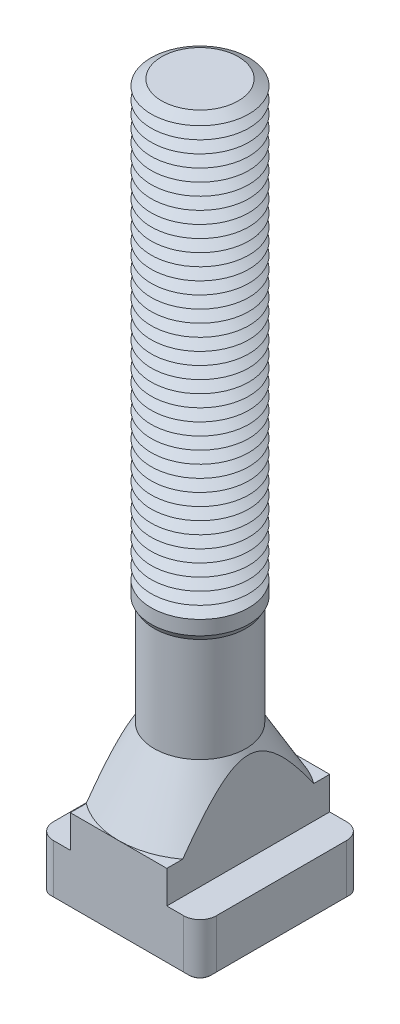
ISO-10303-21;
HEADER;
FILE_DESCRIPTION(('STEP AP214'),'2;1');
FILE_NAME('part.step','',(''),(''),'','','');
FILE_SCHEMA(('AUTOMOTIVE_DESIGN { 1 0 10303 214 1 1 1 1 }'));
ENDSEC;
DATA;
#1=APPLICATION_CONTEXT('core data for automotive mechanical design processes');
#2=APPLICATION_PROTOCOL_DEFINITION('international standard','automotive_design',2000,#1);
#3=PRODUCT_CONTEXT('',#1,'mechanical');
#4=PRODUCT('Part','Part','',(#3));
#5=PRODUCT_RELATED_PRODUCT_CATEGORY('part','',(#4));
#6=PRODUCT_DEFINITION_FORMATION('','',#4);
#7=PRODUCT_DEFINITION_CONTEXT('part definition',#1,'design');
#8=PRODUCT_DEFINITION('design','',#6,#7);
#9=PRODUCT_DEFINITION_SHAPE('','',#8);
#10=(LENGTH_UNIT() NAMED_UNIT(*) SI_UNIT(.MILLI.,.METRE.));
#11=(NAMED_UNIT(*) PLANE_ANGLE_UNIT() SI_UNIT($,.RADIAN.));
#12=(NAMED_UNIT(*) SI_UNIT($,.STERADIAN.) SOLID_ANGLE_UNIT());
#13=UNCERTAINTY_MEASURE_WITH_UNIT(LENGTH_MEASURE(1.E-05),#10,'distance_accuracy_value','');
#14=(GEOMETRIC_REPRESENTATION_CONTEXT(3) GLOBAL_UNCERTAINTY_ASSIGNED_CONTEXT((#13)) GLOBAL_UNIT_ASSIGNED_CONTEXT((#10,
#11,#12)) REPRESENTATION_CONTEXT('',''));
#15=CARTESIAN_POINT('',(0.,0.,0.));
#16=DIRECTION('',(0.,0.,1.));
#17=DIRECTION('',(1.,0.,0.));
#18=AXIS2_PLACEMENT_3D('',#15,#16,#17);
#19=CARTESIAN_POINT('',(0.,164.,0.));
#20=DIRECTION('',(0.,-1.,0.));
#21=DIRECTION('',(0.,0.,-1.));
#22=AXIS2_PLACEMENT_3D('',#19,#20,#21);
#23=CONICAL_SURFACE('',#22,9.4019237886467,1.0471975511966);
#24=CARTESIAN_POINT('',(0.,162.5,0.));
#25=DIRECTION('',(0.,-1.,0.));
#26=DIRECTION('',(0.,0.,-1.));
#27=AXIS2_PLACEMENT_3D('',#24,#25,#26);
#28=CIRCLE('',#27,12.);
#29=CARTESIAN_POINT('',(0.,162.5,-12.));
#30=VERTEX_POINT('',#29);
#31=EDGE_CURVE('E661',#30,#30,#28,.T.);
#32=ORIENTED_EDGE('',*,*,#31,.F.);
#33=EDGE_LOOP('',(#32));
#34=FACE_BOUND('',#33,.T.);
#35=CARTESIAN_POINT('',(0.,164.,0.));
#36=DIRECTION('',(0.,-1.,0.));
#37=DIRECTION('',(0.,0.,-1.));
#38=AXIS2_PLACEMENT_3D('',#35,#36,#37);
#39=CIRCLE('',#38,9.4019237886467);
#40=CARTESIAN_POINT('',(0.,164.,-9.4019237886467));
#41=VERTEX_POINT('',#40);
#42=EDGE_CURVE('E1675',#41,#41,#39,.T.);
#43=ORIENTED_EDGE('',*,*,#42,.T.);
#44=EDGE_LOOP('',(#43));
#45=FACE_BOUND('',#44,.T.);
#46=ADVANCED_FACE('F39',(#34,#45),#23,.T.);
#47=CARTESIAN_POINT('',(0.,165.5,0.));
#48=DIRECTION('',(0.,1.,0.));
#49=DIRECTION('',(0.,0.,1.));
#50=AXIS2_PLACEMENT_3D('',#47,#48,#49);
#51=CONICAL_SURFACE('',#50,12.,1.0471975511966);
#52=ORIENTED_EDGE('',*,*,#42,.F.);
#53=EDGE_LOOP('',(#52));
#54=FACE_BOUND('',#53,.T.);
#55=CARTESIAN_POINT('',(0.,165.5,0.));
#56=DIRECTION('',(0.,-1.,0.));
#57=DIRECTION('',(0.,0.,-1.));
#58=AXIS2_PLACEMENT_3D('',#55,#56,#57);
#59=CIRCLE('',#58,12.);
#60=CARTESIAN_POINT('',(0.,165.5,-12.));
#61=VERTEX_POINT('',#60);
#62=EDGE_CURVE('E1679',#61,#61,#59,.T.);
#63=ORIENTED_EDGE('',*,*,#62,.T.);
#64=EDGE_LOOP('',(#63));
#65=FACE_BOUND('',#64,.T.);
#66=ADVANCED_FACE('F449',(#54,#65),#51,.T.);
#67=CARTESIAN_POINT('',(5.31382001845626,176.,0.));
#68=DIRECTION('',(0.,-1.,0.));
#69=DIRECTION('',(1.,0.,0.));
#70=AXIS2_PLACEMENT_3D('',#67,#68,#69);
#71=PLANE('',#70);
#72=CARTESIAN_POINT('',(0.,176.,0.));
#73=DIRECTION('',(0.,-1.,0.));
#74=DIRECTION('',(0.,0.,-1.));
#75=AXIS2_PLACEMENT_3D('',#72,#73,#74);
#76=CIRCLE('',#75,9.4019237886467);
#77=CARTESIAN_POINT('',(0.,176.,-9.4019237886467));
#78=VERTEX_POINT('',#77);
#79=EDGE_CURVE('E685',#78,#78,#76,.T.);
#80=ORIENTED_EDGE('',*,*,#79,.F.);
#81=EDGE_LOOP('',(#80));
#82=FACE_BOUND('',#81,.T.);
#83=ADVANCED_FACE('F455',(#82),#71,.F.);
#84=CARTESIAN_POINT('',(0.,176.,0.));
#85=DIRECTION('',(0.,-1.,0.));
#86=DIRECTION('',(0.,0.,-1.));
#87=AXIS2_PLACEMENT_3D('',#84,#85,#86);
#88=CONICAL_SURFACE('',#87,9.4019237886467,1.0471975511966);
#89=CARTESIAN_POINT('',(0.,174.5,0.));
#90=DIRECTION('',(0.,-1.,0.));
#91=DIRECTION('',(0.,0.,-1.));
#92=AXIS2_PLACEMENT_3D('',#89,#90,#91);
#93=CIRCLE('',#92,12.);
#94=CARTESIAN_POINT('',(0.,174.5,-12.));
#95=VERTEX_POINT('',#94);
#96=EDGE_CURVE('E678',#95,#95,#93,.T.);
#97=ORIENTED_EDGE('',*,*,#96,.F.);
#98=EDGE_LOOP('',(#97));
#99=FACE_BOUND('',#98,.T.);
#100=ORIENTED_EDGE('',*,*,#79,.T.);
#101=EDGE_LOOP('',(#100));
#102=FACE_BOUND('',#101,.T.);
#103=ADVANCED_FACE('F483',(#99,#102),#88,.T.);
#104=CARTESIAN_POINT('',(0.,174.5,0.));
#105=DIRECTION('',(0.,1.,0.));
#106=DIRECTION('',(0.,0.,1.));
#107=AXIS2_PLACEMENT_3D('',#104,#105,#106);
#108=CONICAL_SURFACE('',#107,12.,1.0471975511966);
#109=CARTESIAN_POINT('',(0.,173.,0.));
#110=DIRECTION('',(0.,-1.,0.));
#111=DIRECTION('',(0.,0.,-1.));
#112=AXIS2_PLACEMENT_3D('',#109,#110,#111);
#113=CIRCLE('',#112,9.4019237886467);
#114=CARTESIAN_POINT('',(0.,173.,-9.4019237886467));
#115=VERTEX_POINT('',#114);
#116=EDGE_CURVE('E676',#115,#115,#113,.T.);
#117=ORIENTED_EDGE('',*,*,#116,.F.);
#118=EDGE_LOOP('',(#117));
#119=FACE_BOUND('',#118,.T.);
#120=ORIENTED_EDGE('',*,*,#96,.T.);
#121=EDGE_LOOP('',(#120));
#122=FACE_BOUND('',#121,.T.);
#123=ADVANCED_FACE('F480',(#119,#122),#108,.T.);
#124=CARTESIAN_POINT('',(0.,173.,0.));
#125=DIRECTION('',(0.,-1.,0.));
#126=DIRECTION('',(0.,0.,-1.));
#127=AXIS2_PLACEMENT_3D('',#124,#125,#126);
#128=CONICAL_SURFACE('',#127,9.4019237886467,1.0471975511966);
#129=CARTESIAN_POINT('',(0.,171.5,0.));
#130=DIRECTION('',(0.,-1.,0.));
#131=DIRECTION('',(0.,0.,-1.));
#132=AXIS2_PLACEMENT_3D('',#129,#130,#131);
#133=CIRCLE('',#132,12.);
#134=CARTESIAN_POINT('',(0.,171.5,-12.));
#135=VERTEX_POINT('',#134);
#136=EDGE_CURVE('E679',#135,#135,#133,.T.);
#137=ORIENTED_EDGE('',*,*,#136,.F.);
#138=EDGE_LOOP('',(#137));
#139=FACE_BOUND('',#138,.T.);
#140=ORIENTED_EDGE('',*,*,#116,.T.);
#141=EDGE_LOOP('',(#140));
#142=FACE_BOUND('',#141,.T.);
#143=ADVANCED_FACE('F475',(#139,#142),#128,.T.);
#144=CARTESIAN_POINT('',(0.,171.5,0.));
#145=DIRECTION('',(0.,1.,0.));
#146=DIRECTION('',(0.,0.,1.));
#147=AXIS2_PLACEMENT_3D('',#144,#145,#146);
#148=CONICAL_SURFACE('',#147,12.,1.0471975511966);
#149=CARTESIAN_POINT('',(0.,170.,0.));
#150=DIRECTION('',(0.,-1.,0.));
#151=DIRECTION('',(0.,0.,-1.));
#152=AXIS2_PLACEMENT_3D('',#149,#150,#151);
#153=CIRCLE('',#152,9.4019237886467);
#154=CARTESIAN_POINT('',(0.,170.,-9.4019237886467));
#155=VERTEX_POINT('',#154);
#156=EDGE_CURVE('E689',#155,#155,#153,.T.);
#157=ORIENTED_EDGE('',*,*,#156,.F.);
#158=EDGE_LOOP('',(#157));
#159=FACE_BOUND('',#158,.T.);
#160=ORIENTED_EDGE('',*,*,#136,.T.);
#161=EDGE_LOOP('',(#160));
#162=FACE_BOUND('',#161,.T.);
#163=ADVANCED_FACE('F472',(#159,#162),#148,.T.);
#164=CARTESIAN_POINT('',(0.,170.,0.));
#165=DIRECTION('',(0.,-1.,0.));
#166=DIRECTION('',(0.,0.,-1.));
#167=AXIS2_PLACEMENT_3D('',#164,#165,#166);
#168=CONICAL_SURFACE('',#167,9.4019237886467,1.0471975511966);
#169=CARTESIAN_POINT('',(0.,168.5,0.));
#170=DIRECTION('',(0.,-1.,0.));
#171=DIRECTION('',(0.,0.,-1.));
#172=AXIS2_PLACEMENT_3D('',#169,#170,#171);
#173=CIRCLE('',#172,12.);
#174=CARTESIAN_POINT('',(0.,168.5,-12.));
#175=VERTEX_POINT('',#174);
#176=EDGE_CURVE('E1687',#175,#175,#173,.T.);
#177=ORIENTED_EDGE('',*,*,#176,.F.);
#178=EDGE_LOOP('',(#177));
#179=FACE_BOUND('',#178,.T.);
#180=ORIENTED_EDGE('',*,*,#156,.T.);
#181=EDGE_LOOP('',(#180));
#182=FACE_BOUND('',#181,.T.);
#183=ADVANCED_FACE('F466',(#179,#182),#168,.T.);
#184=CARTESIAN_POINT('',(0.,168.5,0.));
#185=DIRECTION('',(0.,1.,0.));
#186=DIRECTION('',(0.,0.,1.));
#187=AXIS2_PLACEMENT_3D('',#184,#185,#186);
#188=CONICAL_SURFACE('',#187,12.,1.0471975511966);
#189=CARTESIAN_POINT('',(0.,167.,0.));
#190=DIRECTION('',(0.,-1.,0.));
#191=DIRECTION('',(0.,0.,-1.));
#192=AXIS2_PLACEMENT_3D('',#189,#190,#191);
#193=CIRCLE('',#192,9.4019237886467);
#194=CARTESIAN_POINT('',(0.,167.,-9.4019237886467));
#195=VERTEX_POINT('',#194);
#196=EDGE_CURVE('E635',#195,#195,#193,.T.);
#197=ORIENTED_EDGE('',*,*,#196,.F.);
#198=EDGE_LOOP('',(#197));
#199=FACE_BOUND('',#198,.T.);
#200=ORIENTED_EDGE('',*,*,#176,.T.);
#201=EDGE_LOOP('',(#200));
#202=FACE_BOUND('',#201,.T.);
#203=ADVANCED_FACE('F462',(#199,#202),#188,.T.);
#204=CARTESIAN_POINT('',(0.,167.,0.));
#205=DIRECTION('',(0.,-1.,0.));
#206=DIRECTION('',(0.,0.,-1.));
#207=AXIS2_PLACEMENT_3D('',#204,#205,#206);
#208=CONICAL_SURFACE('',#207,9.4019237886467,1.0471975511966);
#209=ORIENTED_EDGE('',*,*,#62,.F.);
#210=EDGE_LOOP('',(#209));
#211=FACE_BOUND('',#210,.T.);
#212=ORIENTED_EDGE('',*,*,#196,.T.);
#213=EDGE_LOOP('',(#212));
#214=FACE_BOUND('',#213,.T.);
#215=ADVANCED_FACE('F465',(#211,#214),#208,.T.);
#216=CARTESIAN_POINT('',(0.,161.,0.));
#217=DIRECTION('',(0.,-1.,0.));
#218=DIRECTION('',(0.,0.,-1.));
#219=AXIS2_PLACEMENT_3D('',#216,#217,#218);
#220=CONICAL_SURFACE('',#219,9.4019237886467,1.0471975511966);
#221=CARTESIAN_POINT('',(0.,159.5,0.));
#222=DIRECTION('',(0.,-1.,0.));
#223=DIRECTION('',(0.,0.,-1.));
#224=AXIS2_PLACEMENT_3D('',#221,#222,#223);
#225=CIRCLE('',#224,12.);
#226=CARTESIAN_POINT('',(0.,159.5,-12.));
#227=VERTEX_POINT('',#226);
#228=EDGE_CURVE('E662',#227,#227,#225,.T.);
#229=ORIENTED_EDGE('',*,*,#228,.F.);
#230=EDGE_LOOP('',(#229));
#231=FACE_BOUND('',#230,.T.);
#232=CARTESIAN_POINT('',(0.,161.,0.));
#233=DIRECTION('',(0.,-1.,0.));
#234=DIRECTION('',(0.,0.,-1.));
#235=AXIS2_PLACEMENT_3D('',#232,#233,#234);
#236=CIRCLE('',#235,9.4019237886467);
#237=CARTESIAN_POINT('',(0.,161.,-9.4019237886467));
#238=VERTEX_POINT('',#237);
#239=EDGE_CURVE('E658',#238,#238,#236,.T.);
#240=ORIENTED_EDGE('',*,*,#239,.T.);
#241=EDGE_LOOP('',(#240));
#242=FACE_BOUND('',#241,.T.);
#243=ADVANCED_FACE('F470',(#231,#242),#220,.T.);
#244=CARTESIAN_POINT('',(0.,162.5,0.));
#245=DIRECTION('',(0.,1.,0.));
#246=DIRECTION('',(0.,0.,1.));
#247=AXIS2_PLACEMENT_3D('',#244,#245,#246);
#248=CONICAL_SURFACE('',#247,12.,1.0471975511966);
#249=ORIENTED_EDGE('',*,*,#239,.F.);
#250=EDGE_LOOP('',(#249));
#251=FACE_BOUND('',#250,.T.);
#252=ORIENTED_EDGE('',*,*,#31,.T.);
#253=EDGE_LOOP('',(#252));
#254=FACE_BOUND('',#253,.T.);
#255=ADVANCED_FACE('F1434',(#251,#254),#248,.T.);
#256=CARTESIAN_POINT('',(0.,158.,0.));
#257=DIRECTION('',(0.,-1.,0.));
#258=DIRECTION('',(0.,0.,-1.));
#259=AXIS2_PLACEMENT_3D('',#256,#257,#258);
#260=CONICAL_SURFACE('',#259,9.4019237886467,1.0471975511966);
#261=CARTESIAN_POINT('',(0.,156.5,0.));
#262=DIRECTION('',(0.,-1.,0.));
#263=DIRECTION('',(0.,0.,-1.));
#264=AXIS2_PLACEMENT_3D('',#261,#262,#263);
#265=CIRCLE('',#264,12.);
#266=CARTESIAN_POINT('',(0.,156.5,-12.));
#267=VERTEX_POINT('',#266);
#268=EDGE_CURVE('E1734',#267,#267,#265,.T.);
#269=ORIENTED_EDGE('',*,*,#268,.F.);
#270=EDGE_LOOP('',(#269));
#271=FACE_BOUND('',#270,.T.);
#272=CARTESIAN_POINT('',(0.,158.,0.));
#273=DIRECTION('',(0.,-1.,0.));
#274=DIRECTION('',(0.,0.,-1.));
#275=AXIS2_PLACEMENT_3D('',#272,#273,#274);
#276=CIRCLE('',#275,9.4019237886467);
#277=CARTESIAN_POINT('',(0.,158.,-9.4019237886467));
#278=VERTEX_POINT('',#277);
#279=EDGE_CURVE('E1745',#278,#278,#276,.T.);
#280=ORIENTED_EDGE('',*,*,#279,.T.);
#281=EDGE_LOOP('',(#280));
#282=FACE_BOUND('',#281,.T.);
#283=ADVANCED_FACE('F1424',(#271,#282),#260,.T.);
#284=CARTESIAN_POINT('',(0.,159.5,0.));
#285=DIRECTION('',(0.,1.,0.));
#286=DIRECTION('',(0.,0.,1.));
#287=AXIS2_PLACEMENT_3D('',#284,#285,#286);
#288=CONICAL_SURFACE('',#287,12.,1.0471975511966);
#289=ORIENTED_EDGE('',*,*,#279,.F.);
#290=EDGE_LOOP('',(#289));
#291=FACE_BOUND('',#290,.T.);
#292=ORIENTED_EDGE('',*,*,#228,.T.);
#293=EDGE_LOOP('',(#292));
#294=FACE_BOUND('',#293,.T.);
#295=ADVANCED_FACE('F1414',(#291,#294),#288,.T.);
#296=CARTESIAN_POINT('',(0.,155.,0.));
#297=DIRECTION('',(0.,-1.,0.));
#298=DIRECTION('',(0.,0.,-1.));
#299=AXIS2_PLACEMENT_3D('',#296,#297,#298);
#300=CONICAL_SURFACE('',#299,9.4019237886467,1.0471975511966);
#301=CARTESIAN_POINT('',(0.,153.5,0.));
#302=DIRECTION('',(0.,-1.,0.));
#303=DIRECTION('',(0.,0.,-1.));
#304=AXIS2_PLACEMENT_3D('',#301,#302,#303);
#305=CIRCLE('',#304,12.);
#306=CARTESIAN_POINT('',(0.,153.5,-12.));
#307=VERTEX_POINT('',#306);
#308=EDGE_CURVE('E1725',#307,#307,#305,.T.);
#309=ORIENTED_EDGE('',*,*,#308,.F.);
#310=EDGE_LOOP('',(#309));
#311=FACE_BOUND('',#310,.T.);
#312=CARTESIAN_POINT('',(0.,155.,0.));
#313=DIRECTION('',(0.,-1.,0.));
#314=DIRECTION('',(0.,0.,-1.));
#315=AXIS2_PLACEMENT_3D('',#312,#313,#314);
#316=CIRCLE('',#315,9.4019237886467);
#317=CARTESIAN_POINT('',(0.,155.,-9.4019237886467));
#318=VERTEX_POINT('',#317);
#319=EDGE_CURVE('E1727',#318,#318,#316,.T.);
#320=ORIENTED_EDGE('',*,*,#319,.T.);
#321=EDGE_LOOP('',(#320));
#322=FACE_BOUND('',#321,.T.);
#323=ADVANCED_FACE('F1404',(#311,#322),#300,.T.);
#324=CARTESIAN_POINT('',(0.,156.5,0.));
#325=DIRECTION('',(0.,1.,0.));
#326=DIRECTION('',(0.,0.,1.));
#327=AXIS2_PLACEMENT_3D('',#324,#325,#326);
#328=CONICAL_SURFACE('',#327,12.,1.0471975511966);
#329=ORIENTED_EDGE('',*,*,#319,.F.);
#330=EDGE_LOOP('',(#329));
#331=FACE_BOUND('',#330,.T.);
#332=ORIENTED_EDGE('',*,*,#268,.T.);
#333=EDGE_LOOP('',(#332));
#334=FACE_BOUND('',#333,.T.);
#335=ADVANCED_FACE('F1394',(#331,#334),#328,.T.);
#336=CARTESIAN_POINT('',(0.,152.,0.));
#337=DIRECTION('',(0.,-1.,0.));
#338=DIRECTION('',(0.,0.,-1.));
#339=AXIS2_PLACEMENT_3D('',#336,#337,#338);
#340=CONICAL_SURFACE('',#339,9.4019237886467,1.0471975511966);
#341=CARTESIAN_POINT('',(0.,150.5,0.));
#342=DIRECTION('',(0.,-1.,0.));
#343=DIRECTION('',(0.,0.,-1.));
#344=AXIS2_PLACEMENT_3D('',#341,#342,#343);
#345=CIRCLE('',#344,12.);
#346=CARTESIAN_POINT('',(0.,150.5,-12.));
#347=VERTEX_POINT('',#346);
#348=EDGE_CURVE('E1738',#347,#347,#345,.T.);
#349=ORIENTED_EDGE('',*,*,#348,.F.);
#350=EDGE_LOOP('',(#349));
#351=FACE_BOUND('',#350,.T.);
#352=CARTESIAN_POINT('',(0.,152.,0.));
#353=DIRECTION('',(0.,-1.,0.));
#354=DIRECTION('',(0.,0.,-1.));
#355=AXIS2_PLACEMENT_3D('',#352,#353,#354);
#356=CIRCLE('',#355,9.4019237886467);
#357=CARTESIAN_POINT('',(0.,152.,-9.4019237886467));
#358=VERTEX_POINT('',#357);
#359=EDGE_CURVE('E1728',#358,#358,#356,.T.);
#360=ORIENTED_EDGE('',*,*,#359,.T.);
#361=EDGE_LOOP('',(#360));
#362=FACE_BOUND('',#361,.T.);
#363=ADVANCED_FACE('F1384',(#351,#362),#340,.T.);
#364=CARTESIAN_POINT('',(0.,153.5,0.));
#365=DIRECTION('',(0.,1.,0.));
#366=DIRECTION('',(0.,0.,1.));
#367=AXIS2_PLACEMENT_3D('',#364,#365,#366);
#368=CONICAL_SURFACE('',#367,12.,1.0471975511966);
#369=ORIENTED_EDGE('',*,*,#359,.F.);
#370=EDGE_LOOP('',(#369));
#371=FACE_BOUND('',#370,.T.);
#372=ORIENTED_EDGE('',*,*,#308,.T.);
#373=EDGE_LOOP('',(#372));
#374=FACE_BOUND('',#373,.T.);
#375=ADVANCED_FACE('F1374',(#371,#374),#368,.T.);
#376=CARTESIAN_POINT('',(0.,149.,0.));
#377=DIRECTION('',(0.,-1.,0.));
#378=DIRECTION('',(0.,0.,-1.));
#379=AXIS2_PLACEMENT_3D('',#376,#377,#378);
#380=CONICAL_SURFACE('',#379,9.4019237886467,1.0471975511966);
#381=CARTESIAN_POINT('',(0.,147.5,0.));
#382=DIRECTION('',(0.,-1.,0.));
#383=DIRECTION('',(0.,0.,-1.));
#384=AXIS2_PLACEMENT_3D('',#381,#382,#383);
#385=CIRCLE('',#384,12.);
#386=CARTESIAN_POINT('',(0.,147.5,-12.));
#387=VERTEX_POINT('',#386);
#388=EDGE_CURVE('E1697',#387,#387,#385,.T.);
#389=ORIENTED_EDGE('',*,*,#388,.F.);
#390=EDGE_LOOP('',(#389));
#391=FACE_BOUND('',#390,.T.);
#392=CARTESIAN_POINT('',(0.,149.,0.));
#393=DIRECTION('',(0.,-1.,0.));
#394=DIRECTION('',(0.,0.,-1.));
#395=AXIS2_PLACEMENT_3D('',#392,#393,#394);
#396=CIRCLE('',#395,9.4019237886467);
#397=CARTESIAN_POINT('',(0.,149.,-9.4019237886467));
#398=VERTEX_POINT('',#397);
#399=EDGE_CURVE('E1843',#398,#398,#396,.T.);
#400=ORIENTED_EDGE('',*,*,#399,.T.);
#401=EDGE_LOOP('',(#400));
#402=FACE_BOUND('',#401,.T.);
#403=ADVANCED_FACE('F1364',(#391,#402),#380,.T.);
#404=CARTESIAN_POINT('',(0.,150.5,0.));
#405=DIRECTION('',(0.,1.,0.));
#406=DIRECTION('',(0.,0.,1.));
#407=AXIS2_PLACEMENT_3D('',#404,#405,#406);
#408=CONICAL_SURFACE('',#407,12.,1.0471975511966);
#409=ORIENTED_EDGE('',*,*,#399,.F.);
#410=EDGE_LOOP('',(#409));
#411=FACE_BOUND('',#410,.T.);
#412=ORIENTED_EDGE('',*,*,#348,.T.);
#413=EDGE_LOOP('',(#412));
#414=FACE_BOUND('',#413,.T.);
#415=ADVANCED_FACE('F1354',(#411,#414),#408,.T.);
#416=CARTESIAN_POINT('',(0.,146.,0.));
#417=DIRECTION('',(0.,-1.,0.));
#418=DIRECTION('',(0.,0.,-1.));
#419=AXIS2_PLACEMENT_3D('',#416,#417,#418);
#420=CONICAL_SURFACE('',#419,9.4019237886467,1.0471975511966);
#421=CARTESIAN_POINT('',(0.,144.5,0.));
#422=DIRECTION('',(0.,-1.,0.));
#423=DIRECTION('',(0.,0.,-1.));
#424=AXIS2_PLACEMENT_3D('',#421,#422,#423);
#425=CIRCLE('',#424,12.);
#426=CARTESIAN_POINT('',(0.,144.5,-12.));
#427=VERTEX_POINT('',#426);
#428=EDGE_CURVE('E652',#427,#427,#425,.T.);
#429=ORIENTED_EDGE('',*,*,#428,.F.);
#430=EDGE_LOOP('',(#429));
#431=FACE_BOUND('',#430,.T.);
#432=CARTESIAN_POINT('',(0.,146.,0.));
#433=DIRECTION('',(0.,-1.,0.));
#434=DIRECTION('',(0.,0.,-1.));
#435=AXIS2_PLACEMENT_3D('',#432,#433,#434);
#436=CIRCLE('',#435,9.4019237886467);
#437=CARTESIAN_POINT('',(0.,146.,-9.4019237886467));
#438=VERTEX_POINT('',#437);
#439=EDGE_CURVE('E655',#438,#438,#436,.T.);
#440=ORIENTED_EDGE('',*,*,#439,.T.);
#441=EDGE_LOOP('',(#440));
#442=FACE_BOUND('',#441,.T.);
#443=ADVANCED_FACE('F1344',(#431,#442),#420,.T.);
#444=CARTESIAN_POINT('',(0.,147.5,0.));
#445=DIRECTION('',(0.,1.,0.));
#446=DIRECTION('',(0.,0.,1.));
#447=AXIS2_PLACEMENT_3D('',#444,#445,#446);
#448=CONICAL_SURFACE('',#447,12.,1.0471975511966);
#449=ORIENTED_EDGE('',*,*,#439,.F.);
#450=EDGE_LOOP('',(#449));
#451=FACE_BOUND('',#450,.T.);
#452=ORIENTED_EDGE('',*,*,#388,.T.);
#453=EDGE_LOOP('',(#452));
#454=FACE_BOUND('',#453,.T.);
#455=ADVANCED_FACE('F1334',(#451,#454),#448,.T.);
#456=CARTESIAN_POINT('',(0.,143.,0.));
#457=DIRECTION('',(0.,-1.,0.));
#458=DIRECTION('',(0.,0.,-1.));
#459=AXIS2_PLACEMENT_3D('',#456,#457,#458);
#460=CONICAL_SURFACE('',#459,9.4019237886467,1.0471975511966);
#461=CARTESIAN_POINT('',(0.,141.5,0.));
#462=DIRECTION('',(0.,-1.,0.));
#463=DIRECTION('',(0.,0.,-1.));
#464=AXIS2_PLACEMENT_3D('',#461,#462,#463);
#465=CIRCLE('',#464,12.);
#466=CARTESIAN_POINT('',(0.,141.5,-12.));
#467=VERTEX_POINT('',#466);
#468=EDGE_CURVE('E1834',#467,#467,#465,.T.);
#469=ORIENTED_EDGE('',*,*,#468,.F.);
#470=EDGE_LOOP('',(#469));
#471=FACE_BOUND('',#470,.T.);
#472=CARTESIAN_POINT('',(0.,143.,0.));
#473=DIRECTION('',(0.,-1.,0.));
#474=DIRECTION('',(0.,0.,-1.));
#475=AXIS2_PLACEMENT_3D('',#472,#473,#474);
#476=CIRCLE('',#475,9.4019237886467);
#477=CARTESIAN_POINT('',(0.,143.,-9.4019237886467));
#478=VERTEX_POINT('',#477);
#479=EDGE_CURVE('E656',#478,#478,#476,.T.);
#480=ORIENTED_EDGE('',*,*,#479,.T.);
#481=EDGE_LOOP('',(#480));
#482=FACE_BOUND('',#481,.T.);
#483=ADVANCED_FACE('F1324',(#471,#482),#460,.T.);
#484=CARTESIAN_POINT('',(0.,144.5,0.));
#485=DIRECTION('',(0.,1.,0.));
#486=DIRECTION('',(0.,0.,1.));
#487=AXIS2_PLACEMENT_3D('',#484,#485,#486);
#488=CONICAL_SURFACE('',#487,12.,1.0471975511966);
#489=ORIENTED_EDGE('',*,*,#479,.F.);
#490=EDGE_LOOP('',(#489));
#491=FACE_BOUND('',#490,.T.);
#492=ORIENTED_EDGE('',*,*,#428,.T.);
#493=EDGE_LOOP('',(#492));
#494=FACE_BOUND('',#493,.T.);
#495=ADVANCED_FACE('F1314',(#491,#494),#488,.T.);
#496=CARTESIAN_POINT('',(0.,140.,0.));
#497=DIRECTION('',(0.,-1.,0.));
#498=DIRECTION('',(0.,0.,-1.));
#499=AXIS2_PLACEMENT_3D('',#496,#497,#498);
#500=CONICAL_SURFACE('',#499,9.4019237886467,1.0471975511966);
#501=CARTESIAN_POINT('',(0.,138.5,0.));
#502=DIRECTION('',(0.,-1.,0.));
#503=DIRECTION('',(0.,0.,-1.));
#504=AXIS2_PLACEMENT_3D('',#501,#502,#503);
#505=CIRCLE('',#504,12.);
#506=CARTESIAN_POINT('',(0.,138.5,-12.));
#507=VERTEX_POINT('',#506);
#508=EDGE_CURVE('E1827',#507,#507,#505,.T.);
#509=ORIENTED_EDGE('',*,*,#508,.F.);
#510=EDGE_LOOP('',(#509));
#511=FACE_BOUND('',#510,.T.);
#512=CARTESIAN_POINT('',(0.,140.,0.));
#513=DIRECTION('',(0.,-1.,0.));
#514=DIRECTION('',(0.,0.,-1.));
#515=AXIS2_PLACEMENT_3D('',#512,#513,#514);
#516=CIRCLE('',#515,9.4019237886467);
#517=CARTESIAN_POINT('',(0.,140.,-9.4019237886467));
#518=VERTEX_POINT('',#517);
#519=EDGE_CURVE('E1831',#518,#518,#516,.T.);
#520=ORIENTED_EDGE('',*,*,#519,.T.);
#521=EDGE_LOOP('',(#520));
#522=FACE_BOUND('',#521,.T.);
#523=ADVANCED_FACE('F1304',(#511,#522),#500,.T.);
#524=CARTESIAN_POINT('',(0.,141.5,0.));
#525=DIRECTION('',(0.,1.,0.));
#526=DIRECTION('',(0.,0.,1.));
#527=AXIS2_PLACEMENT_3D('',#524,#525,#526);
#528=CONICAL_SURFACE('',#527,12.,1.0471975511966);
#529=ORIENTED_EDGE('',*,*,#519,.F.);
#530=EDGE_LOOP('',(#529));
#531=FACE_BOUND('',#530,.T.);
#532=ORIENTED_EDGE('',*,*,#468,.T.);
#533=EDGE_LOOP('',(#532));
#534=FACE_BOUND('',#533,.T.);
#535=ADVANCED_FACE('F1294',(#531,#534),#528,.T.);
#536=CARTESIAN_POINT('',(0.,137.,0.));
#537=DIRECTION('',(0.,-1.,0.));
#538=DIRECTION('',(0.,0.,-1.));
#539=AXIS2_PLACEMENT_3D('',#536,#537,#538);
#540=CONICAL_SURFACE('',#539,9.4019237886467,1.0471975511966);
#541=CARTESIAN_POINT('',(0.,135.5,0.));
#542=DIRECTION('',(0.,-1.,0.));
#543=DIRECTION('',(0.,0.,-1.));
#544=AXIS2_PLACEMENT_3D('',#541,#542,#543);
#545=CIRCLE('',#544,12.);
#546=CARTESIAN_POINT('',(0.,135.5,-12.));
#547=VERTEX_POINT('',#546);
#548=EDGE_CURVE('E673',#547,#547,#545,.T.);
#549=ORIENTED_EDGE('',*,*,#548,.F.);
#550=EDGE_LOOP('',(#549));
#551=FACE_BOUND('',#550,.T.);
#552=CARTESIAN_POINT('',(0.,137.,0.));
#553=DIRECTION('',(0.,-1.,0.));
#554=DIRECTION('',(0.,0.,-1.));
#555=AXIS2_PLACEMENT_3D('',#552,#553,#554);
#556=CIRCLE('',#555,9.4019237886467);
#557=CARTESIAN_POINT('',(0.,137.,-9.4019237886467));
#558=VERTEX_POINT('',#557);
#559=EDGE_CURVE('E1823',#558,#558,#556,.T.);
#560=ORIENTED_EDGE('',*,*,#559,.T.);
#561=EDGE_LOOP('',(#560));
#562=FACE_BOUND('',#561,.T.);
#563=ADVANCED_FACE('F1284',(#551,#562),#540,.T.);
#564=CARTESIAN_POINT('',(0.,138.5,0.));
#565=DIRECTION('',(0.,1.,0.));
#566=DIRECTION('',(0.,0.,1.));
#567=AXIS2_PLACEMENT_3D('',#564,#565,#566);
#568=CONICAL_SURFACE('',#567,12.,1.0471975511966);
#569=ORIENTED_EDGE('',*,*,#559,.F.);
#570=EDGE_LOOP('',(#569));
#571=FACE_BOUND('',#570,.T.);
#572=ORIENTED_EDGE('',*,*,#508,.T.);
#573=EDGE_LOOP('',(#572));
#574=FACE_BOUND('',#573,.T.);
#575=ADVANCED_FACE('F1274',(#571,#574),#568,.T.);
#576=CARTESIAN_POINT('',(0.,134.,0.));
#577=DIRECTION('',(0.,-1.,0.));
#578=DIRECTION('',(0.,0.,-1.));
#579=AXIS2_PLACEMENT_3D('',#576,#577,#578);
#580=CONICAL_SURFACE('',#579,9.4019237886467,1.0471975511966);
#581=CARTESIAN_POINT('',(0.,132.5,0.));
#582=DIRECTION('',(0.,-1.,0.));
#583=DIRECTION('',(0.,0.,-1.));
#584=AXIS2_PLACEMENT_3D('',#581,#582,#583);
#585=CIRCLE('',#584,12.);
#586=CARTESIAN_POINT('',(0.,132.5,-12.));
#587=VERTEX_POINT('',#586);
#588=EDGE_CURVE('E674',#587,#587,#585,.T.);
#589=ORIENTED_EDGE('',*,*,#588,.F.);
#590=EDGE_LOOP('',(#589));
#591=FACE_BOUND('',#590,.T.);
#592=CARTESIAN_POINT('',(0.,134.,0.));
#593=DIRECTION('',(0.,-1.,0.));
#594=DIRECTION('',(0.,0.,-1.));
#595=AXIS2_PLACEMENT_3D('',#592,#593,#594);
#596=CIRCLE('',#595,9.4019237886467);
#597=CARTESIAN_POINT('',(0.,134.,-9.4019237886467));
#598=VERTEX_POINT('',#597);
#599=EDGE_CURVE('E670',#598,#598,#596,.T.);
#600=ORIENTED_EDGE('',*,*,#599,.T.);
#601=EDGE_LOOP('',(#600));
#602=FACE_BOUND('',#601,.T.);
#603=ADVANCED_FACE('F1264',(#591,#602),#580,.T.);
#604=CARTESIAN_POINT('',(0.,135.5,0.));
#605=DIRECTION('',(0.,1.,0.));
#606=DIRECTION('',(0.,0.,1.));
#607=AXIS2_PLACEMENT_3D('',#604,#605,#606);
#608=CONICAL_SURFACE('',#607,12.,1.0471975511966);
#609=ORIENTED_EDGE('',*,*,#599,.F.);
#610=EDGE_LOOP('',(#609));
#611=FACE_BOUND('',#610,.T.);
#612=ORIENTED_EDGE('',*,*,#548,.T.);
#613=EDGE_LOOP('',(#612));
#614=FACE_BOUND('',#613,.T.);
#615=ADVANCED_FACE('F1254',(#611,#614),#608,.T.);
#616=CARTESIAN_POINT('',(0.,131.,0.));
#617=DIRECTION('',(0.,-1.,0.));
#618=DIRECTION('',(0.,0.,-1.));
#619=AXIS2_PLACEMENT_3D('',#616,#617,#618);
#620=CONICAL_SURFACE('',#619,9.4019237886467,1.0471975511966);
#621=CARTESIAN_POINT('',(0.,129.5,0.));
#622=DIRECTION('',(0.,-1.,0.));
#623=DIRECTION('',(0.,0.,-1.));
#624=AXIS2_PLACEMENT_3D('',#621,#622,#623);
#625=CIRCLE('',#624,12.);
#626=CARTESIAN_POINT('',(0.,129.5,-12.));
#627=VERTEX_POINT('',#626);
#628=EDGE_CURVE('E1776',#627,#627,#625,.T.);
#629=ORIENTED_EDGE('',*,*,#628,.F.);
#630=EDGE_LOOP('',(#629));
#631=FACE_BOUND('',#630,.T.);
#632=CARTESIAN_POINT('',(0.,131.,0.));
#633=DIRECTION('',(0.,-1.,0.));
#634=DIRECTION('',(0.,0.,-1.));
#635=AXIS2_PLACEMENT_3D('',#632,#633,#634);
#636=CIRCLE('',#635,9.4019237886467);
#637=CARTESIAN_POINT('',(0.,131.,-9.4019237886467));
#638=VERTEX_POINT('',#637);
#639=EDGE_CURVE('E1712',#638,#638,#636,.T.);
#640=ORIENTED_EDGE('',*,*,#639,.T.);
#641=EDGE_LOOP('',(#640));
#642=FACE_BOUND('',#641,.T.);
#643=ADVANCED_FACE('F1244',(#631,#642),#620,.T.);
#644=CARTESIAN_POINT('',(0.,132.5,0.));
#645=DIRECTION('',(0.,1.,0.));
#646=DIRECTION('',(0.,0.,1.));
#647=AXIS2_PLACEMENT_3D('',#644,#645,#646);
#648=CONICAL_SURFACE('',#647,12.,1.0471975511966);
#649=ORIENTED_EDGE('',*,*,#639,.F.);
#650=EDGE_LOOP('',(#649));
#651=FACE_BOUND('',#650,.T.);
#652=ORIENTED_EDGE('',*,*,#588,.T.);
#653=EDGE_LOOP('',(#652));
#654=FACE_BOUND('',#653,.T.);
#655=ADVANCED_FACE('F1234',(#651,#654),#648,.T.);
#656=CARTESIAN_POINT('',(0.,128.,0.));
#657=DIRECTION('',(0.,-1.,0.));
#658=DIRECTION('',(0.,0.,-1.));
#659=AXIS2_PLACEMENT_3D('',#656,#657,#658);
#660=CONICAL_SURFACE('',#659,9.4019237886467,1.0471975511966);
#661=CARTESIAN_POINT('',(0.,126.5,0.));
#662=DIRECTION('',(0.,-1.,0.));
#663=DIRECTION('',(0.,0.,-1.));
#664=AXIS2_PLACEMENT_3D('',#661,#662,#663);
#665=CIRCLE('',#664,12.);
#666=CARTESIAN_POINT('',(0.,126.5,-12.));
#667=VERTEX_POINT('',#666);
#668=EDGE_CURVE('E1810',#667,#667,#665,.T.);
#669=ORIENTED_EDGE('',*,*,#668,.F.);
#670=EDGE_LOOP('',(#669));
#671=FACE_BOUND('',#670,.T.);
#672=CARTESIAN_POINT('',(0.,128.,0.));
#673=DIRECTION('',(0.,-1.,0.));
#674=DIRECTION('',(0.,0.,-1.));
#675=AXIS2_PLACEMENT_3D('',#672,#673,#674);
#676=CIRCLE('',#675,9.4019237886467);
#677=CARTESIAN_POINT('',(0.,128.,-9.4019237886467));
#678=VERTEX_POINT('',#677);
#679=EDGE_CURVE('E1778',#678,#678,#676,.T.);
#680=ORIENTED_EDGE('',*,*,#679,.T.);
#681=EDGE_LOOP('',(#680));
#682=FACE_BOUND('',#681,.T.);
#683=ADVANCED_FACE('F1224',(#671,#682),#660,.T.);
#684=CARTESIAN_POINT('',(0.,129.5,0.));
#685=DIRECTION('',(0.,1.,0.));
#686=DIRECTION('',(0.,0.,1.));
#687=AXIS2_PLACEMENT_3D('',#684,#685,#686);
#688=CONICAL_SURFACE('',#687,12.,1.0471975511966);
#689=ORIENTED_EDGE('',*,*,#679,.F.);
#690=EDGE_LOOP('',(#689));
#691=FACE_BOUND('',#690,.T.);
#692=ORIENTED_EDGE('',*,*,#628,.T.);
#693=EDGE_LOOP('',(#692));
#694=FACE_BOUND('',#693,.T.);
#695=ADVANCED_FACE('F1214',(#691,#694),#688,.T.);
#696=CARTESIAN_POINT('',(0.,125.,0.));
#697=DIRECTION('',(0.,-1.,0.));
#698=DIRECTION('',(0.,0.,-1.));
#699=AXIS2_PLACEMENT_3D('',#696,#697,#698);
#700=CONICAL_SURFACE('',#699,9.4019237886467,1.0471975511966);
#701=CARTESIAN_POINT('',(0.,123.5,0.));
#702=DIRECTION('',(0.,-1.,0.));
#703=DIRECTION('',(0.,0.,-1.));
#704=AXIS2_PLACEMENT_3D('',#701,#702,#703);
#705=CIRCLE('',#704,12.);
#706=CARTESIAN_POINT('',(0.,123.5,-12.));
#707=VERTEX_POINT('',#706);
#708=EDGE_CURVE('E1723',#707,#707,#705,.T.);
#709=ORIENTED_EDGE('',*,*,#708,.F.);
#710=EDGE_LOOP('',(#709));
#711=FACE_BOUND('',#710,.T.);
#712=CARTESIAN_POINT('',(0.,125.,0.));
#713=DIRECTION('',(0.,-1.,0.));
#714=DIRECTION('',(0.,0.,-1.));
#715=AXIS2_PLACEMENT_3D('',#712,#713,#714);
#716=CIRCLE('',#715,9.4019237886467);
#717=CARTESIAN_POINT('',(0.,125.,-9.4019237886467));
#718=VERTEX_POINT('',#717);
#719=EDGE_CURVE('E1806',#718,#718,#716,.T.);
#720=ORIENTED_EDGE('',*,*,#719,.T.);
#721=EDGE_LOOP('',(#720));
#722=FACE_BOUND('',#721,.T.);
#723=ADVANCED_FACE('F1204',(#711,#722),#700,.T.);
#724=CARTESIAN_POINT('',(0.,126.5,0.));
#725=DIRECTION('',(0.,1.,0.));
#726=DIRECTION('',(0.,0.,1.));
#727=AXIS2_PLACEMENT_3D('',#724,#725,#726);
#728=CONICAL_SURFACE('',#727,12.,1.0471975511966);
#729=ORIENTED_EDGE('',*,*,#719,.F.);
#730=EDGE_LOOP('',(#729));
#731=FACE_BOUND('',#730,.T.);
#732=ORIENTED_EDGE('',*,*,#668,.T.);
#733=EDGE_LOOP('',(#732));
#734=FACE_BOUND('',#733,.T.);
#735=ADVANCED_FACE('F1194',(#731,#734),#728,.T.);
#736=CARTESIAN_POINT('',(0.,122.,0.));
#737=DIRECTION('',(0.,-1.,0.));
#738=DIRECTION('',(0.,0.,-1.));
#739=AXIS2_PLACEMENT_3D('',#736,#737,#738);
#740=CONICAL_SURFACE('',#739,9.4019237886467,1.0471975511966);
#741=CARTESIAN_POINT('',(0.,120.5,0.));
#742=DIRECTION('',(0.,-1.,0.));
#743=DIRECTION('',(0.,0.,-1.));
#744=AXIS2_PLACEMENT_3D('',#741,#742,#743);
#745=CIRCLE('',#744,12.);
#746=CARTESIAN_POINT('',(0.,120.5,-12.));
#747=VERTEX_POINT('',#746);
#748=EDGE_CURVE('E1708',#747,#747,#745,.T.);
#749=ORIENTED_EDGE('',*,*,#748,.F.);
#750=EDGE_LOOP('',(#749));
#751=FACE_BOUND('',#750,.T.);
#752=CARTESIAN_POINT('',(0.,122.,0.));
#753=DIRECTION('',(0.,-1.,0.));
#754=DIRECTION('',(0.,0.,-1.));
#755=AXIS2_PLACEMENT_3D('',#752,#753,#754);
#756=CIRCLE('',#755,9.4019237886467);
#757=CARTESIAN_POINT('',(0.,122.,-9.4019237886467));
#758=VERTEX_POINT('',#757);
#759=EDGE_CURVE('E1721',#758,#758,#756,.T.);
#760=ORIENTED_EDGE('',*,*,#759,.T.);
#761=EDGE_LOOP('',(#760));
#762=FACE_BOUND('',#761,.T.);
#763=ADVANCED_FACE('F1184',(#751,#762),#740,.T.);
#764=CARTESIAN_POINT('',(0.,123.5,0.));
#765=DIRECTION('',(0.,1.,0.));
#766=DIRECTION('',(0.,0.,1.));
#767=AXIS2_PLACEMENT_3D('',#764,#765,#766);
#768=CONICAL_SURFACE('',#767,12.,1.0471975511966);
#769=ORIENTED_EDGE('',*,*,#759,.F.);
#770=EDGE_LOOP('',(#769));
#771=FACE_BOUND('',#770,.T.);
#772=ORIENTED_EDGE('',*,*,#708,.T.);
#773=EDGE_LOOP('',(#772));
#774=FACE_BOUND('',#773,.T.);
#775=ADVANCED_FACE('F1174',(#771,#774),#768,.T.);
#776=CARTESIAN_POINT('',(0.,119.,0.));
#777=DIRECTION('',(0.,-1.,0.));
#778=DIRECTION('',(0.,0.,-1.));
#779=AXIS2_PLACEMENT_3D('',#776,#777,#778);
#780=CONICAL_SURFACE('',#779,9.4019237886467,1.0471975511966);
#781=CARTESIAN_POINT('',(0.,117.5,0.));
#782=DIRECTION('',(0.,-1.,0.));
#783=DIRECTION('',(0.,0.,-1.));
#784=AXIS2_PLACEMENT_3D('',#781,#782,#783);
#785=CIRCLE('',#784,12.);
#786=CARTESIAN_POINT('',(0.,117.5,-12.));
#787=VERTEX_POINT('',#786);
#788=EDGE_CURVE('E1709',#787,#787,#785,.T.);
#789=ORIENTED_EDGE('',*,*,#788,.F.);
#790=EDGE_LOOP('',(#789));
#791=FACE_BOUND('',#790,.T.);
#792=CARTESIAN_POINT('',(0.,119.,0.));
#793=DIRECTION('',(0.,-1.,0.));
#794=DIRECTION('',(0.,0.,-1.));
#795=AXIS2_PLACEMENT_3D('',#792,#793,#794);
#796=CIRCLE('',#795,9.4019237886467);
#797=CARTESIAN_POINT('',(0.,119.,-9.4019237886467));
#798=VERTEX_POINT('',#797);
#799=EDGE_CURVE('E1705',#798,#798,#796,.T.);
#800=ORIENTED_EDGE('',*,*,#799,.T.);
#801=EDGE_LOOP('',(#800));
#802=FACE_BOUND('',#801,.T.);
#803=ADVANCED_FACE('F1164',(#791,#802),#780,.T.);
#804=CARTESIAN_POINT('',(0.,120.5,0.));
#805=DIRECTION('',(0.,1.,0.));
#806=DIRECTION('',(0.,0.,1.));
#807=AXIS2_PLACEMENT_3D('',#804,#805,#806);
#808=CONICAL_SURFACE('',#807,12.,1.0471975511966);
#809=ORIENTED_EDGE('',*,*,#799,.F.);
#810=EDGE_LOOP('',(#809));
#811=FACE_BOUND('',#810,.T.);
#812=ORIENTED_EDGE('',*,*,#748,.T.);
#813=EDGE_LOOP('',(#812));
#814=FACE_BOUND('',#813,.T.);
#815=ADVANCED_FACE('F1154',(#811,#814),#808,.T.);
#816=CARTESIAN_POINT('',(0.,116.,0.));
#817=DIRECTION('',(0.,-1.,0.));
#818=DIRECTION('',(0.,0.,-1.));
#819=AXIS2_PLACEMENT_3D('',#816,#817,#818);
#820=CONICAL_SURFACE('',#819,9.4019237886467,1.0471975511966);
#821=CARTESIAN_POINT('',(0.,114.5,0.));
#822=DIRECTION('',(0.,-1.,0.));
#823=DIRECTION('',(0.,0.,-1.));
#824=AXIS2_PLACEMENT_3D('',#821,#822,#823);
#825=CIRCLE('',#824,12.);
#826=CARTESIAN_POINT('',(0.,114.5,-12.));
#827=VERTEX_POINT('',#826);
#828=EDGE_CURVE('E1758',#827,#827,#825,.T.);
#829=ORIENTED_EDGE('',*,*,#828,.F.);
#830=EDGE_LOOP('',(#829));
#831=FACE_BOUND('',#830,.T.);
#832=CARTESIAN_POINT('',(0.,116.,0.));
#833=DIRECTION('',(0.,-1.,0.));
#834=DIRECTION('',(0.,0.,-1.));
#835=AXIS2_PLACEMENT_3D('',#832,#833,#834);
#836=CIRCLE('',#835,9.4019237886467);
#837=CARTESIAN_POINT('',(0.,116.,-9.4019237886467));
#838=VERTEX_POINT('',#837);
#839=EDGE_CURVE('E1761',#838,#838,#836,.T.);
#840=ORIENTED_EDGE('',*,*,#839,.T.);
#841=EDGE_LOOP('',(#840));
#842=FACE_BOUND('',#841,.T.);
#843=ADVANCED_FACE('F1144',(#831,#842),#820,.T.);
#844=CARTESIAN_POINT('',(0.,117.5,0.));
#845=DIRECTION('',(0.,1.,0.));
#846=DIRECTION('',(0.,0.,1.));
#847=AXIS2_PLACEMENT_3D('',#844,#845,#846);
#848=CONICAL_SURFACE('',#847,12.,1.0471975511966);
#849=ORIENTED_EDGE('',*,*,#839,.F.);
#850=EDGE_LOOP('',(#849));
#851=FACE_BOUND('',#850,.T.);
#852=ORIENTED_EDGE('',*,*,#788,.T.);
#853=EDGE_LOOP('',(#852));
#854=FACE_BOUND('',#853,.T.);
#855=ADVANCED_FACE('F1134',(#851,#854),#848,.T.);
#856=CARTESIAN_POINT('',(0.,113.,0.));
#857=DIRECTION('',(0.,-1.,0.));
#858=DIRECTION('',(0.,0.,-1.));
#859=AXIS2_PLACEMENT_3D('',#856,#857,#858);
#860=CONICAL_SURFACE('',#859,9.4019237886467,1.0471975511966);
#861=CARTESIAN_POINT('',(0.,111.5,0.));
#862=DIRECTION('',(0.,-1.,0.));
#863=DIRECTION('',(0.,0.,-1.));
#864=AXIS2_PLACEMENT_3D('',#861,#862,#863);
#865=CIRCLE('',#864,12.);
#866=CARTESIAN_POINT('',(0.,111.5,-12.));
#867=VERTEX_POINT('',#866);
#868=EDGE_CURVE('E1785',#867,#867,#865,.T.);
#869=ORIENTED_EDGE('',*,*,#868,.F.);
#870=EDGE_LOOP('',(#869));
#871=FACE_BOUND('',#870,.T.);
#872=CARTESIAN_POINT('',(0.,113.,0.));
#873=DIRECTION('',(0.,-1.,0.));
#874=DIRECTION('',(0.,0.,-1.));
#875=AXIS2_PLACEMENT_3D('',#872,#873,#874);
#876=CIRCLE('',#875,9.4019237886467);
#877=CARTESIAN_POINT('',(0.,113.,-9.4019237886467));
#878=VERTEX_POINT('',#877);
#879=EDGE_CURVE('E1762',#878,#878,#876,.T.);
#880=ORIENTED_EDGE('',*,*,#879,.T.);
#881=EDGE_LOOP('',(#880));
#882=FACE_BOUND('',#881,.T.);
#883=ADVANCED_FACE('F1124',(#871,#882),#860,.T.);
#884=CARTESIAN_POINT('',(0.,114.5,0.));
#885=DIRECTION('',(0.,1.,0.));
#886=DIRECTION('',(0.,0.,1.));
#887=AXIS2_PLACEMENT_3D('',#884,#885,#886);
#888=CONICAL_SURFACE('',#887,12.,1.0471975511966);
#889=ORIENTED_EDGE('',*,*,#879,.F.);
#890=EDGE_LOOP('',(#889));
#891=FACE_BOUND('',#890,.T.);
#892=ORIENTED_EDGE('',*,*,#828,.T.);
#893=EDGE_LOOP('',(#892));
#894=FACE_BOUND('',#893,.T.);
#895=ADVANCED_FACE('F1114',(#891,#894),#888,.T.);
#896=CARTESIAN_POINT('',(0.,110.,0.));
#897=DIRECTION('',(0.,-1.,0.));
#898=DIRECTION('',(0.,0.,-1.));
#899=AXIS2_PLACEMENT_3D('',#896,#897,#898);
#900=CONICAL_SURFACE('',#899,9.4019237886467,1.0471975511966);
#901=CARTESIAN_POINT('',(0.,108.5,0.));
#902=DIRECTION('',(0.,-1.,0.));
#903=DIRECTION('',(0.,0.,-1.));
#904=AXIS2_PLACEMENT_3D('',#901,#902,#903);
#905=CIRCLE('',#904,12.);
#906=CARTESIAN_POINT('',(0.,108.5,-12.));
#907=VERTEX_POINT('',#906);
#908=EDGE_CURVE('E1879',#907,#907,#905,.T.);
#909=ORIENTED_EDGE('',*,*,#908,.F.);
#910=EDGE_LOOP('',(#909));
#911=FACE_BOUND('',#910,.T.);
#912=CARTESIAN_POINT('',(0.,110.,0.));
#913=DIRECTION('',(0.,-1.,0.));
#914=DIRECTION('',(0.,0.,-1.));
#915=AXIS2_PLACEMENT_3D('',#912,#913,#914);
#916=CIRCLE('',#915,9.4019237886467);
#917=CARTESIAN_POINT('',(0.,110.,-9.4019237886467));
#918=VERTEX_POINT('',#917);
#919=EDGE_CURVE('E1791',#918,#918,#916,.T.);
#920=ORIENTED_EDGE('',*,*,#919,.T.);
#921=EDGE_LOOP('',(#920));
#922=FACE_BOUND('',#921,.T.);
#923=ADVANCED_FACE('F1104',(#911,#922),#900,.T.);
#924=CARTESIAN_POINT('',(0.,111.5,0.));
#925=DIRECTION('',(0.,1.,0.));
#926=DIRECTION('',(0.,0.,1.));
#927=AXIS2_PLACEMENT_3D('',#924,#925,#926);
#928=CONICAL_SURFACE('',#927,12.,1.0471975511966);
#929=ORIENTED_EDGE('',*,*,#919,.F.);
#930=EDGE_LOOP('',(#929));
#931=FACE_BOUND('',#930,.T.);
#932=ORIENTED_EDGE('',*,*,#868,.T.);
#933=EDGE_LOOP('',(#932));
#934=FACE_BOUND('',#933,.T.);
#935=ADVANCED_FACE('F1094',(#931,#934),#928,.T.);
#936=CARTESIAN_POINT('',(0.,107.,0.));
#937=DIRECTION('',(0.,-1.,0.));
#938=DIRECTION('',(0.,0.,-1.));
#939=AXIS2_PLACEMENT_3D('',#936,#937,#938);
#940=CONICAL_SURFACE('',#939,9.4019237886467,1.0471975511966);
#941=CARTESIAN_POINT('',(0.,105.5,0.));
#942=DIRECTION('',(0.,-1.,0.));
#943=DIRECTION('',(0.,0.,-1.));
#944=AXIS2_PLACEMENT_3D('',#941,#942,#943);
#945=CIRCLE('',#944,12.);
#946=CARTESIAN_POINT('',(0.,105.5,-12.));
#947=VERTEX_POINT('',#946);
#948=EDGE_CURVE('E1700',#947,#947,#945,.T.);
#949=ORIENTED_EDGE('',*,*,#948,.F.);
#950=EDGE_LOOP('',(#949));
#951=FACE_BOUND('',#950,.T.);
#952=CARTESIAN_POINT('',(0.,107.,0.));
#953=DIRECTION('',(0.,-1.,0.));
#954=DIRECTION('',(0.,0.,-1.));
#955=AXIS2_PLACEMENT_3D('',#952,#953,#954);
#956=CIRCLE('',#955,9.4019237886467);
#957=CARTESIAN_POINT('',(0.,107.,-9.4019237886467));
#958=VERTEX_POINT('',#957);
#959=EDGE_CURVE('E1703',#958,#958,#956,.T.);
#960=ORIENTED_EDGE('',*,*,#959,.T.);
#961=EDGE_LOOP('',(#960));
#962=FACE_BOUND('',#961,.T.);
#963=ADVANCED_FACE('F1084',(#951,#962),#940,.T.);
#964=CARTESIAN_POINT('',(0.,108.5,0.));
#965=DIRECTION('',(0.,1.,0.));
#966=DIRECTION('',(0.,0.,1.));
#967=AXIS2_PLACEMENT_3D('',#964,#965,#966);
#968=CONICAL_SURFACE('',#967,12.,1.0471975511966);
#969=ORIENTED_EDGE('',*,*,#959,.F.);
#970=EDGE_LOOP('',(#969));
#971=FACE_BOUND('',#970,.T.);
#972=ORIENTED_EDGE('',*,*,#908,.T.);
#973=EDGE_LOOP('',(#972));
#974=FACE_BOUND('',#973,.T.);
#975=ADVANCED_FACE('F1074',(#971,#974),#968,.T.);
#976=CARTESIAN_POINT('',(0.,104.,0.));
#977=DIRECTION('',(0.,-1.,0.));
#978=DIRECTION('',(0.,0.,-1.));
#979=AXIS2_PLACEMENT_3D('',#976,#977,#978);
#980=CONICAL_SURFACE('',#979,9.4019237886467,1.0471975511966);
#981=CARTESIAN_POINT('',(0.,102.5,0.));
#982=DIRECTION('',(0.,-1.,0.));
#983=DIRECTION('',(0.,0.,-1.));
#984=AXIS2_PLACEMENT_3D('',#981,#982,#983);
#985=CIRCLE('',#984,12.);
#986=CARTESIAN_POINT('',(0.,102.5,-12.));
#987=VERTEX_POINT('',#986);
#988=EDGE_CURVE('E649',#987,#987,#985,.T.);
#989=ORIENTED_EDGE('',*,*,#988,.F.);
#990=EDGE_LOOP('',(#989));
#991=FACE_BOUND('',#990,.T.);
#992=CARTESIAN_POINT('',(0.,104.,0.));
#993=DIRECTION('',(0.,-1.,0.));
#994=DIRECTION('',(0.,0.,-1.));
#995=AXIS2_PLACEMENT_3D('',#992,#993,#994);
#996=CIRCLE('',#995,9.4019237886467);
#997=CARTESIAN_POINT('',(0.,104.,-9.4019237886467));
#998=VERTEX_POINT('',#997);
#999=EDGE_CURVE('E668',#998,#998,#996,.T.);
#1000=ORIENTED_EDGE('',*,*,#999,.T.);
#1001=EDGE_LOOP('',(#1000));
#1002=FACE_BOUND('',#1001,.T.);
#1003=ADVANCED_FACE('F1064',(#991,#1002),#980,.T.);
#1004=CARTESIAN_POINT('',(0.,105.5,0.));
#1005=DIRECTION('',(0.,1.,0.));
#1006=DIRECTION('',(0.,0.,1.));
#1007=AXIS2_PLACEMENT_3D('',#1004,#1005,#1006);
#1008=CONICAL_SURFACE('',#1007,12.,1.0471975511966);
#1009=ORIENTED_EDGE('',*,*,#999,.F.);
#1010=EDGE_LOOP('',(#1009));
#1011=FACE_BOUND('',#1010,.T.);
#1012=ORIENTED_EDGE('',*,*,#948,.T.);
#1013=EDGE_LOOP('',(#1012));
#1014=FACE_BOUND('',#1013,.T.);
#1015=ADVANCED_FACE('F1054',(#1011,#1014),#1008,.T.);
#1016=CARTESIAN_POINT('',(0.,101.,0.));
#1017=DIRECTION('',(0.,-1.,0.));
#1018=DIRECTION('',(0.,0.,-1.));
#1019=AXIS2_PLACEMENT_3D('',#1016,#1017,#1018);
#1020=CONICAL_SURFACE('',#1019,9.4019237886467,1.0471975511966);
#1021=CARTESIAN_POINT('',(0.,99.5,0.));
#1022=DIRECTION('',(0.,-1.,0.));
#1023=DIRECTION('',(0.,0.,-1.));
#1024=AXIS2_PLACEMENT_3D('',#1021,#1022,#1023);
#1025=CIRCLE('',#1024,12.);
#1026=CARTESIAN_POINT('',(0.,99.5,-12.));
#1027=VERTEX_POINT('',#1026);
#1028=EDGE_CURVE('E650',#1027,#1027,#1025,.T.);
#1029=ORIENTED_EDGE('',*,*,#1028,.F.);
#1030=EDGE_LOOP('',(#1029));
#1031=FACE_BOUND('',#1030,.T.);
#1032=CARTESIAN_POINT('',(0.,101.,0.));
#1033=DIRECTION('',(0.,-1.,0.));
#1034=DIRECTION('',(0.,0.,-1.));
#1035=AXIS2_PLACEMENT_3D('',#1032,#1033,#1034);
#1036=CIRCLE('',#1035,9.4019237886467);
#1037=CARTESIAN_POINT('',(0.,101.,-9.4019237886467));
#1038=VERTEX_POINT('',#1037);
#1039=EDGE_CURVE('E646',#1038,#1038,#1036,.T.);
#1040=ORIENTED_EDGE('',*,*,#1039,.T.);
#1041=EDGE_LOOP('',(#1040));
#1042=FACE_BOUND('',#1041,.T.);
#1043=ADVANCED_FACE('F1044',(#1031,#1042),#1020,.T.);
#1044=CARTESIAN_POINT('',(0.,102.5,0.));
#1045=DIRECTION('',(0.,1.,0.));
#1046=DIRECTION('',(0.,0.,1.));
#1047=AXIS2_PLACEMENT_3D('',#1044,#1045,#1046);
#1048=CONICAL_SURFACE('',#1047,12.,1.0471975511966);
#1049=ORIENTED_EDGE('',*,*,#1039,.F.);
#1050=EDGE_LOOP('',(#1049));
#1051=FACE_BOUND('',#1050,.T.);
#1052=ORIENTED_EDGE('',*,*,#988,.T.);
#1053=EDGE_LOOP('',(#1052));
#1054=FACE_BOUND('',#1053,.T.);
#1055=ADVANCED_FACE('F1034',(#1051,#1054),#1048,.T.);
#1056=CARTESIAN_POINT('',(0.,98.,0.));
#1057=DIRECTION('',(0.,-1.,0.));
#1058=DIRECTION('',(0.,0.,-1.));
#1059=AXIS2_PLACEMENT_3D('',#1056,#1057,#1058);
#1060=CONICAL_SURFACE('',#1059,9.4019237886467,1.0471975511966);
#1061=CARTESIAN_POINT('',(0.,96.5,0.));
#1062=DIRECTION('',(0.,-1.,0.));
#1063=DIRECTION('',(0.,0.,-1.));
#1064=AXIS2_PLACEMENT_3D('',#1061,#1062,#1063);
#1065=CIRCLE('',#1064,12.);
#1066=CARTESIAN_POINT('',(0.,96.5,-12.));
#1067=VERTEX_POINT('',#1066);
#1068=EDGE_CURVE('E1866',#1067,#1067,#1065,.T.);
#1069=ORIENTED_EDGE('',*,*,#1068,.F.);
#1070=EDGE_LOOP('',(#1069));
#1071=FACE_BOUND('',#1070,.T.);
#1072=CARTESIAN_POINT('',(0.,98.,0.));
#1073=DIRECTION('',(0.,-1.,0.));
#1074=DIRECTION('',(0.,0.,-1.));
#1075=AXIS2_PLACEMENT_3D('',#1072,#1073,#1074);
#1076=CIRCLE('',#1075,9.4019237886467);
#1077=CARTESIAN_POINT('',(0.,98.,-9.4019237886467));
#1078=VERTEX_POINT('',#1077);
#1079=EDGE_CURVE('E1870',#1078,#1078,#1076,.T.);
#1080=ORIENTED_EDGE('',*,*,#1079,.T.);
#1081=EDGE_LOOP('',(#1080));
#1082=FACE_BOUND('',#1081,.T.);
#1083=ADVANCED_FACE('F1024',(#1071,#1082),#1060,.T.);
#1084=CARTESIAN_POINT('',(0.,99.5,0.));
#1085=DIRECTION('',(0.,1.,0.));
#1086=DIRECTION('',(0.,0.,1.));
#1087=AXIS2_PLACEMENT_3D('',#1084,#1085,#1086);
#1088=CONICAL_SURFACE('',#1087,12.,1.0471975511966);
#1089=ORIENTED_EDGE('',*,*,#1079,.F.);
#1090=EDGE_LOOP('',(#1089));
#1091=FACE_BOUND('',#1090,.T.);
#1092=ORIENTED_EDGE('',*,*,#1028,.T.);
#1093=EDGE_LOOP('',(#1092));
#1094=FACE_BOUND('',#1093,.T.);
#1095=ADVANCED_FACE('F1014',(#1091,#1094),#1088,.T.);
#1096=CARTESIAN_POINT('',(0.,95.,0.));
#1097=DIRECTION('',(0.,-1.,0.));
#1098=DIRECTION('',(0.,0.,-1.));
#1099=AXIS2_PLACEMENT_3D('',#1096,#1097,#1098);
#1100=CONICAL_SURFACE('',#1099,9.4019237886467,1.0471975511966);
#1101=CARTESIAN_POINT('',(0.,93.5,0.));
#1102=DIRECTION('',(0.,-1.,0.));
#1103=DIRECTION('',(0.,0.,-1.));
#1104=AXIS2_PLACEMENT_3D('',#1101,#1102,#1103);
#1105=CIRCLE('',#1104,12.);
#1106=CARTESIAN_POINT('',(0.,93.5,-12.));
#1107=VERTEX_POINT('',#1106);
#1108=EDGE_CURVE('E1853',#1107,#1107,#1105,.T.);
#1109=ORIENTED_EDGE('',*,*,#1108,.F.);
#1110=EDGE_LOOP('',(#1109));
#1111=FACE_BOUND('',#1110,.T.);
#1112=CARTESIAN_POINT('',(0.,95.,0.));
#1113=DIRECTION('',(0.,-1.,0.));
#1114=DIRECTION('',(0.,0.,-1.));
#1115=AXIS2_PLACEMENT_3D('',#1112,#1113,#1114);
#1116=CIRCLE('',#1115,9.4019237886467);
#1117=CARTESIAN_POINT('',(0.,95.,-9.4019237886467));
#1118=VERTEX_POINT('',#1117);
#1119=EDGE_CURVE('E1859',#1118,#1118,#1116,.T.);
#1120=ORIENTED_EDGE('',*,*,#1119,.T.);
#1121=EDGE_LOOP('',(#1120));
#1122=FACE_BOUND('',#1121,.T.);
#1123=ADVANCED_FACE('F1004',(#1111,#1122),#1100,.T.);
#1124=CARTESIAN_POINT('',(0.,96.5,0.));
#1125=DIRECTION('',(0.,1.,0.));
#1126=DIRECTION('',(0.,0.,1.));
#1127=AXIS2_PLACEMENT_3D('',#1124,#1125,#1126);
#1128=CONICAL_SURFACE('',#1127,12.,1.0471975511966);
#1129=ORIENTED_EDGE('',*,*,#1119,.F.);
#1130=EDGE_LOOP('',(#1129));
#1131=FACE_BOUND('',#1130,.T.);
#1132=ORIENTED_EDGE('',*,*,#1068,.T.);
#1133=EDGE_LOOP('',(#1132));
#1134=FACE_BOUND('',#1133,.T.);
#1135=ADVANCED_FACE('F994',(#1131,#1134),#1128,.T.);
#1136=CARTESIAN_POINT('',(0.,92.,0.));
#1137=DIRECTION('',(0.,-1.,0.));
#1138=DIRECTION('',(0.,0.,-1.));
#1139=AXIS2_PLACEMENT_3D('',#1136,#1137,#1138);
#1140=CONICAL_SURFACE('',#1139,9.4019237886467,1.0471975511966);
#1141=CARTESIAN_POINT('',(0.,90.5,0.));
#1142=DIRECTION('',(0.,-1.,0.));
#1143=DIRECTION('',(0.,0.,-1.));
#1144=AXIS2_PLACEMENT_3D('',#1141,#1142,#1143);
#1145=CIRCLE('',#1144,12.);
#1146=CARTESIAN_POINT('',(0.,90.5,-12.));
#1147=VERTEX_POINT('',#1146);
#1148=EDGE_CURVE('E1715',#1147,#1147,#1145,.T.);
#1149=ORIENTED_EDGE('',*,*,#1148,.F.);
#1150=EDGE_LOOP('',(#1149));
#1151=FACE_BOUND('',#1150,.T.);
#1152=CARTESIAN_POINT('',(0.,92.,0.));
#1153=DIRECTION('',(0.,-1.,0.));
#1154=DIRECTION('',(0.,0.,-1.));
#1155=AXIS2_PLACEMENT_3D('',#1152,#1153,#1154);
#1156=CIRCLE('',#1155,9.4019237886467);
#1157=CARTESIAN_POINT('',(0.,92.,-9.4019237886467));
#1158=VERTEX_POINT('',#1157);
#1159=EDGE_CURVE('E1718',#1158,#1158,#1156,.T.);
#1160=ORIENTED_EDGE('',*,*,#1159,.T.);
#1161=EDGE_LOOP('',(#1160));
#1162=FACE_BOUND('',#1161,.T.);
#1163=ADVANCED_FACE('F984',(#1151,#1162),#1140,.T.);
#1164=CARTESIAN_POINT('',(0.,93.5,0.));
#1165=DIRECTION('',(0.,1.,0.));
#1166=DIRECTION('',(0.,0.,1.));
#1167=AXIS2_PLACEMENT_3D('',#1164,#1165,#1166);
#1168=CONICAL_SURFACE('',#1167,12.,1.0471975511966);
#1169=ORIENTED_EDGE('',*,*,#1159,.F.);
#1170=EDGE_LOOP('',(#1169));
#1171=FACE_BOUND('',#1170,.T.);
#1172=ORIENTED_EDGE('',*,*,#1108,.T.);
#1173=EDGE_LOOP('',(#1172));
#1174=FACE_BOUND('',#1173,.T.);
#1175=ADVANCED_FACE('F974',(#1171,#1174),#1168,.T.);
#1176=CARTESIAN_POINT('',(0.,89.,0.));
#1177=DIRECTION('',(0.,-1.,0.));
#1178=DIRECTION('',(0.,0.,-1.));
#1179=AXIS2_PLACEMENT_3D('',#1176,#1177,#1178);
#1180=CONICAL_SURFACE('',#1179,9.4019237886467,1.0471975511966);
#1181=CARTESIAN_POINT('',(0.,87.5,0.));
#1182=DIRECTION('',(0.,-1.,0.));
#1183=DIRECTION('',(0.,0.,-1.));
#1184=AXIS2_PLACEMENT_3D('',#1181,#1182,#1183);
#1185=CIRCLE('',#1184,12.);
#1186=CARTESIAN_POINT('',(0.,87.5,-12.));
#1187=VERTEX_POINT('',#1186);
#1188=EDGE_CURVE('E643',#1187,#1187,#1185,.T.);
#1189=ORIENTED_EDGE('',*,*,#1188,.F.);
#1190=EDGE_LOOP('',(#1189));
#1191=FACE_BOUND('',#1190,.T.);
#1192=CARTESIAN_POINT('',(0.,89.,0.));
#1193=DIRECTION('',(0.,-1.,0.));
#1194=DIRECTION('',(0.,0.,-1.));
#1195=AXIS2_PLACEMENT_3D('',#1192,#1193,#1194);
#1196=CIRCLE('',#1195,9.4019237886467);
#1197=CARTESIAN_POINT('',(0.,89.,-9.4019237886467));
#1198=VERTEX_POINT('',#1197);
#1199=EDGE_CURVE('E1719',#1198,#1198,#1196,.T.);
#1200=ORIENTED_EDGE('',*,*,#1199,.T.);
#1201=EDGE_LOOP('',(#1200));
#1202=FACE_BOUND('',#1201,.T.);
#1203=ADVANCED_FACE('F964',(#1191,#1202),#1180,.T.);
#1204=CARTESIAN_POINT('',(0.,90.5,0.));
#1205=DIRECTION('',(0.,1.,0.));
#1206=DIRECTION('',(0.,0.,1.));
#1207=AXIS2_PLACEMENT_3D('',#1204,#1205,#1206);
#1208=CONICAL_SURFACE('',#1207,12.,1.0471975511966);
#1209=ORIENTED_EDGE('',*,*,#1199,.F.);
#1210=EDGE_LOOP('',(#1209));
#1211=FACE_BOUND('',#1210,.T.);
#1212=ORIENTED_EDGE('',*,*,#1148,.T.);
#1213=EDGE_LOOP('',(#1212));
#1214=FACE_BOUND('',#1213,.T.);
#1215=ADVANCED_FACE('F954',(#1211,#1214),#1208,.T.);
#1216=CARTESIAN_POINT('',(0.,86.,0.));
#1217=DIRECTION('',(0.,-1.,0.));
#1218=DIRECTION('',(0.,0.,-1.));
#1219=AXIS2_PLACEMENT_3D('',#1216,#1217,#1218);
#1220=CONICAL_SURFACE('',#1219,9.4019237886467,1.0471975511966);
#1221=CARTESIAN_POINT('',(0.,84.5,0.));
#1222=DIRECTION('',(0.,-1.,0.));
#1223=DIRECTION('',(0.,0.,-1.));
#1224=AXIS2_PLACEMENT_3D('',#1221,#1222,#1223);
#1225=CIRCLE('',#1224,12.);
#1226=CARTESIAN_POINT('',(0.,84.5,-12.));
#1227=VERTEX_POINT('',#1226);
#1228=EDGE_CURVE('E644',#1227,#1227,#1225,.T.);
#1229=ORIENTED_EDGE('',*,*,#1228,.F.);
#1230=EDGE_LOOP('',(#1229));
#1231=FACE_BOUND('',#1230,.T.);
#1232=CARTESIAN_POINT('',(0.,86.,0.));
#1233=DIRECTION('',(0.,-1.,0.));
#1234=DIRECTION('',(0.,0.,-1.));
#1235=AXIS2_PLACEMENT_3D('',#1232,#1233,#1234);
#1236=CIRCLE('',#1235,9.4019237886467);
#1237=CARTESIAN_POINT('',(0.,86.,-9.4019237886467));
#1238=VERTEX_POINT('',#1237);
#1239=EDGE_CURVE('E640',#1238,#1238,#1236,.T.);
#1240=ORIENTED_EDGE('',*,*,#1239,.T.);
#1241=EDGE_LOOP('',(#1240));
#1242=FACE_BOUND('',#1241,.T.);
#1243=ADVANCED_FACE('F944',(#1231,#1242),#1220,.T.);
#1244=CARTESIAN_POINT('',(0.,87.5,0.));
#1245=DIRECTION('',(0.,1.,0.));
#1246=DIRECTION('',(0.,0.,1.));
#1247=AXIS2_PLACEMENT_3D('',#1244,#1245,#1246);
#1248=CONICAL_SURFACE('',#1247,12.,1.0471975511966);
#1249=ORIENTED_EDGE('',*,*,#1239,.F.);
#1250=EDGE_LOOP('',(#1249));
#1251=FACE_BOUND('',#1250,.T.);
#1252=ORIENTED_EDGE('',*,*,#1188,.T.);
#1253=EDGE_LOOP('',(#1252));
#1254=FACE_BOUND('',#1253,.T.);
#1255=ADVANCED_FACE('F934',(#1251,#1254),#1248,.T.);
#1256=CARTESIAN_POINT('',(0.,83.,0.));
#1257=DIRECTION('',(0.,-1.,0.));
#1258=DIRECTION('',(0.,0.,-1.));
#1259=AXIS2_PLACEMENT_3D('',#1256,#1257,#1258);
#1260=CONICAL_SURFACE('',#1259,9.4019237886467,1.0471975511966);
#1261=CARTESIAN_POINT('',(0.,81.5,0.));
#1262=DIRECTION('',(0.,-1.,0.));
#1263=DIRECTION('',(0.,0.,-1.));
#1264=AXIS2_PLACEMENT_3D('',#1261,#1262,#1263);
#1265=CIRCLE('',#1264,12.);
#1266=CARTESIAN_POINT('',(0.,81.5,-12.));
#1267=VERTEX_POINT('',#1266);
#1268=EDGE_CURVE('E1752',#1267,#1267,#1265,.T.);
#1269=ORIENTED_EDGE('',*,*,#1268,.F.);
#1270=EDGE_LOOP('',(#1269));
#1271=FACE_BOUND('',#1270,.T.);
#1272=CARTESIAN_POINT('',(0.,83.,0.));
#1273=DIRECTION('',(0.,-1.,0.));
#1274=DIRECTION('',(0.,0.,-1.));
#1275=AXIS2_PLACEMENT_3D('',#1272,#1273,#1274);
#1276=CIRCLE('',#1275,9.4019237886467);
#1277=CARTESIAN_POINT('',(0.,83.,-9.4019237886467));
#1278=VERTEX_POINT('',#1277);
#1279=EDGE_CURVE('E1755',#1278,#1278,#1276,.T.);
#1280=ORIENTED_EDGE('',*,*,#1279,.T.);
#1281=EDGE_LOOP('',(#1280));
#1282=FACE_BOUND('',#1281,.T.);
#1283=ADVANCED_FACE('F924',(#1271,#1282),#1260,.T.);
#1284=CARTESIAN_POINT('',(0.,84.5,0.));
#1285=DIRECTION('',(0.,1.,0.));
#1286=DIRECTION('',(0.,0.,1.));
#1287=AXIS2_PLACEMENT_3D('',#1284,#1285,#1286);
#1288=CONICAL_SURFACE('',#1287,12.,1.0471975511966);
#1289=ORIENTED_EDGE('',*,*,#1279,.F.);
#1290=EDGE_LOOP('',(#1289));
#1291=FACE_BOUND('',#1290,.T.);
#1292=ORIENTED_EDGE('',*,*,#1228,.T.);
#1293=EDGE_LOOP('',(#1292));
#1294=FACE_BOUND('',#1293,.T.);
#1295=ADVANCED_FACE('F914',(#1291,#1294),#1288,.T.);
#1296=CARTESIAN_POINT('',(0.,80.,0.));
#1297=DIRECTION('',(0.,-1.,0.));
#1298=DIRECTION('',(0.,0.,-1.));
#1299=AXIS2_PLACEMENT_3D('',#1296,#1297,#1298);
#1300=CONICAL_SURFACE('',#1299,9.4019237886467,1.0471975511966);
#1301=CARTESIAN_POINT('',(0.,78.5,0.));
#1302=DIRECTION('',(0.,-1.,0.));
#1303=DIRECTION('',(0.,0.,-1.));
#1304=AXIS2_PLACEMENT_3D('',#1301,#1302,#1303);
#1305=CIRCLE('',#1304,12.);
#1306=CARTESIAN_POINT('',(0.,78.5,-12.));
#1307=VERTEX_POINT('',#1306);
#1308=EDGE_CURVE('E1910',#1307,#1307,#1305,.T.);
#1309=ORIENTED_EDGE('',*,*,#1308,.F.);
#1310=EDGE_LOOP('',(#1309));
#1311=FACE_BOUND('',#1310,.T.);
#1312=CARTESIAN_POINT('',(0.,80.,0.));
#1313=DIRECTION('',(0.,-1.,0.));
#1314=DIRECTION('',(0.,0.,-1.));
#1315=AXIS2_PLACEMENT_3D('',#1312,#1313,#1314);
#1316=CIRCLE('',#1315,9.4019237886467);
#1317=CARTESIAN_POINT('',(0.,80.,-9.4019237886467));
#1318=VERTEX_POINT('',#1317);
#1319=EDGE_CURVE('E1756',#1318,#1318,#1316,.T.);
#1320=ORIENTED_EDGE('',*,*,#1319,.T.);
#1321=EDGE_LOOP('',(#1320));
#1322=FACE_BOUND('',#1321,.T.);
#1323=ADVANCED_FACE('F904',(#1311,#1322),#1300,.T.);
#1324=CARTESIAN_POINT('',(0.,81.5,0.));
#1325=DIRECTION('',(0.,1.,0.));
#1326=DIRECTION('',(0.,0.,1.));
#1327=AXIS2_PLACEMENT_3D('',#1324,#1325,#1326);
#1328=CONICAL_SURFACE('',#1327,12.,1.0471975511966);
#1329=ORIENTED_EDGE('',*,*,#1319,.F.);
#1330=EDGE_LOOP('',(#1329));
#1331=FACE_BOUND('',#1330,.T.);
#1332=ORIENTED_EDGE('',*,*,#1268,.T.);
#1333=EDGE_LOOP('',(#1332));
#1334=FACE_BOUND('',#1333,.T.);
#1335=ADVANCED_FACE('F894',(#1331,#1334),#1328,.T.);
#1336=CARTESIAN_POINT('',(0.,77.,0.));
#1337=DIRECTION('',(0.,-1.,0.));
#1338=DIRECTION('',(0.,0.,-1.));
#1339=AXIS2_PLACEMENT_3D('',#1336,#1337,#1338);
#1340=CONICAL_SURFACE('',#1339,9.4019237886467,1.0471975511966);
#1341=CARTESIAN_POINT('',(0.,75.5,0.));
#1342=DIRECTION('',(0.,-1.,0.));
#1343=DIRECTION('',(0.,0.,-1.));
#1344=AXIS2_PLACEMENT_3D('',#1341,#1342,#1343);
#1345=CIRCLE('',#1344,12.);
#1346=CARTESIAN_POINT('',(0.,75.5,-12.));
#1347=VERTEX_POINT('',#1346);
#1348=EDGE_CURVE('E1891',#1347,#1347,#1345,.T.);
#1349=ORIENTED_EDGE('',*,*,#1348,.F.);
#1350=EDGE_LOOP('',(#1349));
#1351=FACE_BOUND('',#1350,.T.);
#1352=CARTESIAN_POINT('',(0.,77.,0.));
#1353=DIRECTION('',(0.,-1.,0.));
#1354=DIRECTION('',(0.,0.,-1.));
#1355=AXIS2_PLACEMENT_3D('',#1352,#1353,#1354);
#1356=CIRCLE('',#1355,9.4019237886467);
#1357=CARTESIAN_POINT('',(0.,77.,-9.4019237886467));
#1358=VERTEX_POINT('',#1357);
#1359=EDGE_CURVE('E1893',#1358,#1358,#1356,.T.);
#1360=ORIENTED_EDGE('',*,*,#1359,.T.);
#1361=EDGE_LOOP('',(#1360));
#1362=FACE_BOUND('',#1361,.T.);
#1363=ADVANCED_FACE('F884',(#1351,#1362),#1340,.T.);
#1364=CARTESIAN_POINT('',(0.,78.5,0.));
#1365=DIRECTION('',(0.,1.,0.));
#1366=DIRECTION('',(0.,0.,1.));
#1367=AXIS2_PLACEMENT_3D('',#1364,#1365,#1366);
#1368=CONICAL_SURFACE('',#1367,12.,1.0471975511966);
#1369=ORIENTED_EDGE('',*,*,#1359,.F.);
#1370=EDGE_LOOP('',(#1369));
#1371=FACE_BOUND('',#1370,.T.);
#1372=ORIENTED_EDGE('',*,*,#1308,.T.);
#1373=EDGE_LOOP('',(#1372));
#1374=FACE_BOUND('',#1373,.T.);
#1375=ADVANCED_FACE('F874',(#1371,#1374),#1368,.T.);
#1376=CARTESIAN_POINT('',(0.,74.,0.));
#1377=DIRECTION('',(0.,-1.,0.));
#1378=DIRECTION('',(0.,0.,-1.));
#1379=AXIS2_PLACEMENT_3D('',#1376,#1377,#1378);
#1380=CONICAL_SURFACE('',#1379,9.4019237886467,1.0471975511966);
#1381=CARTESIAN_POINT('',(0.,72.5,0.));
#1382=DIRECTION('',(0.,-1.,0.));
#1383=DIRECTION('',(0.,0.,-1.));
#1384=AXIS2_PLACEMENT_3D('',#1381,#1382,#1383);
#1385=CIRCLE('',#1384,12.);
#1386=CARTESIAN_POINT('',(0.,72.5,-12.));
#1387=VERTEX_POINT('',#1386);
#1388=EDGE_CURVE('E1767',#1387,#1387,#1385,.T.);
#1389=ORIENTED_EDGE('',*,*,#1388,.F.);
#1390=EDGE_LOOP('',(#1389));
#1391=FACE_BOUND('',#1390,.T.);
#1392=CARTESIAN_POINT('',(0.,74.,0.));
#1393=DIRECTION('',(0.,-1.,0.));
#1394=DIRECTION('',(0.,0.,-1.));
#1395=AXIS2_PLACEMENT_3D('',#1392,#1393,#1394);
#1396=CIRCLE('',#1395,9.4019237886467);
#1397=CARTESIAN_POINT('',(0.,74.,-9.4019237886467));
#1398=VERTEX_POINT('',#1397);
#1399=EDGE_CURVE('E1894',#1398,#1398,#1396,.T.);
#1400=ORIENTED_EDGE('',*,*,#1399,.T.);
#1401=EDGE_LOOP('',(#1400));
#1402=FACE_BOUND('',#1401,.T.);
#1403=ADVANCED_FACE('F864',(#1391,#1402),#1380,.T.);
#1404=CARTESIAN_POINT('',(0.,75.5,0.));
#1405=DIRECTION('',(0.,1.,0.));
#1406=DIRECTION('',(0.,0.,1.));
#1407=AXIS2_PLACEMENT_3D('',#1404,#1405,#1406);
#1408=CONICAL_SURFACE('',#1407,12.,1.0471975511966);
#1409=ORIENTED_EDGE('',*,*,#1399,.F.);
#1410=EDGE_LOOP('',(#1409));
#1411=FACE_BOUND('',#1410,.T.);
#1412=ORIENTED_EDGE('',*,*,#1348,.T.);
#1413=EDGE_LOOP('',(#1412));
#1414=FACE_BOUND('',#1413,.T.);
#1415=ADVANCED_FACE('F854',(#1411,#1414),#1408,.T.);
#1416=CARTESIAN_POINT('',(0.,71.,0.));
#1417=DIRECTION('',(0.,-1.,0.));
#1418=DIRECTION('',(0.,0.,-1.));
#1419=AXIS2_PLACEMENT_3D('',#1416,#1417,#1418);
#1420=CONICAL_SURFACE('',#1419,9.4019237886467,1.0471975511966);
#1421=CARTESIAN_POINT('',(0.,69.5,0.));
#1422=DIRECTION('',(0.,-1.,0.));
#1423=DIRECTION('',(0.,0.,-1.));
#1424=AXIS2_PLACEMENT_3D('',#1421,#1422,#1423);
#1425=CIRCLE('',#1424,12.);
#1426=CARTESIAN_POINT('',(0.,69.5,-12.));
#1427=VERTEX_POINT('',#1426);
#1428=EDGE_CURVE('E1770',#1427,#1427,#1425,.T.);
#1429=ORIENTED_EDGE('',*,*,#1428,.F.);
#1430=EDGE_LOOP('',(#1429));
#1431=FACE_BOUND('',#1430,.T.);
#1432=CARTESIAN_POINT('',(0.,71.,0.));
#1433=DIRECTION('',(0.,-1.,0.));
#1434=DIRECTION('',(0.,0.,-1.));
#1435=AXIS2_PLACEMENT_3D('',#1432,#1433,#1434);
#1436=CIRCLE('',#1435,9.4019237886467);
#1437=CARTESIAN_POINT('',(0.,71.,-9.4019237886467));
#1438=VERTEX_POINT('',#1437);
#1439=EDGE_CURVE('E1771',#1438,#1438,#1436,.T.);
#1440=ORIENTED_EDGE('',*,*,#1439,.T.);
#1441=EDGE_LOOP('',(#1440));
#1442=FACE_BOUND('',#1441,.T.);
#1443=ADVANCED_FACE('F567',(#1431,#1442),#1420,.T.);
#1444=CARTESIAN_POINT('',(0.,72.5,0.));
#1445=DIRECTION('',(0.,1.,0.));
#1446=DIRECTION('',(0.,0.,1.));
#1447=AXIS2_PLACEMENT_3D('',#1444,#1445,#1446);
#1448=CONICAL_SURFACE('',#1447,12.,1.0471975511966);
#1449=ORIENTED_EDGE('',*,*,#1439,.F.);
#1450=EDGE_LOOP('',(#1449));
#1451=FACE_BOUND('',#1450,.T.);
#1452=ORIENTED_EDGE('',*,*,#1388,.T.);
#1453=EDGE_LOOP('',(#1452));
#1454=FACE_BOUND('',#1453,.T.);
#1455=ADVANCED_FACE('F562',(#1451,#1454),#1448,.T.);
#1456=CARTESIAN_POINT('',(-18.1143819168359,7.77123616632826,-18.1143819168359));
#1457=DIRECTION('',(-0.577350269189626,0.577350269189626,-0.577350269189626));
#1458=DIRECTION('',(-0.707106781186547,0.,0.707106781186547));
#1459=AXIS2_PLACEMENT_3D('',#1456,#1457,#1458);
#1460=CYLINDRICAL_SURFACE('',#1459,4.);
#1461=CARTESIAN_POINT('',(-10.3431457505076,0.,-10.3431457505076));
#1462=DIRECTION('',(0.,1.,0.));
#1463=DIRECTION('',(-0.707106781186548,0.,-0.707106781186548));
#1464=AXIS2_PLACEMENT_3D('',#1461,#1462,#1463);
#1465=ELLIPSE('',#1464,6.92820323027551,4.);
#1466=CARTESIAN_POINT('',(-16.,0.,-13.1715728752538));
#1467=VERTEX_POINT('',#1466);
#1468=CARTESIAN_POINT('',(-13.1715728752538,0.,-16.));
#1469=VERTEX_POINT('',#1468);
#1470=EDGE_CURVE('E325',#1467,#1469,#1465,.F.);
#1471=ORIENTED_EDGE('',*,*,#1470,.F.);
#1472=DIRECTION('',(0.577350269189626,-0.577350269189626,0.577350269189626));
#1473=VECTOR('',#1472,1.);
#1474=CARTESIAN_POINT('',(-7.60947570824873,-8.39052429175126,-4.78104858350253));
#1475=LINE('',#1474,#1473);
#1476=CARTESIAN_POINT('',(-19.8637033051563,3.86370330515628,-17.0352761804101));
#1477=VERTEX_POINT('',#1476);
#1478=EDGE_CURVE('E366',#1477,#1467,#1475,.T.);
#1479=ORIENTED_EDGE('',*,*,#1478,.F.);
#1480=CARTESIAN_POINT('',(-16.,5.65685424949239,-16.));
#1481=DIRECTION('',(0.325057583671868,-0.888073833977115,0.325057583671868));
#1482=DIRECTION('',(-0.627963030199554,-0.459700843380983,-0.627963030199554));
#1483=AXIS2_PLACEMENT_3D('',#1480,#1481,#1482);
#1484=ELLIPSE('',#1483,4.50413000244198,4.);
#1485=CARTESIAN_POINT('',(-17.0352761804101,3.86370330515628,-19.8637033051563));
#1486=VERTEX_POINT('',#1485);
#1487=EDGE_CURVE('E264',#1477,#1486,#1484,.T.);
#1488=ORIENTED_EDGE('',*,*,#1487,.T.);
#1489=DIRECTION('',(0.577350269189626,-0.577350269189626,0.577350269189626));
#1490=VECTOR('',#1489,1.);
#1491=CARTESIAN_POINT('',(-18.1143819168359,4.94280904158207,-20.9428090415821));
#1492=LINE('',#1491,#1490);
#1493=EDGE_CURVE('E359',#1469,#1486,#1492,.F.);
#1494=ORIENTED_EDGE('',*,*,#1493,.F.);
#1495=EDGE_LOOP('',(#1471,#1479,#1488,#1494));
#1496=FACE_BOUND('',#1495,.T.);
#1497=ADVANCED_FACE('F551',(#1496),#1460,.T.);
#1498=CARTESIAN_POINT('',(4.78104858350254,-5.56209716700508,-4.78104858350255));
#1499=DIRECTION('',(0.577350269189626,0.577350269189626,-0.577350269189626));
#1500=DIRECTION('',(-0.707106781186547,0.,-0.707106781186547));
#1501=AXIS2_PLACEMENT_3D('',#1498,#1499,#1500);
#1502=CYLINDRICAL_SURFACE('',#1501,4.);
#1503=CARTESIAN_POINT('',(10.3431457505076,0.,-10.3431457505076));
#1504=DIRECTION('',(0.,1.,0.));
#1505=DIRECTION('',(0.707106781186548,0.,-0.707106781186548));
#1506=AXIS2_PLACEMENT_3D('',#1503,#1504,#1505);
#1507=ELLIPSE('',#1506,6.92820323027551,4.);
#1508=CARTESIAN_POINT('',(13.1715728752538,0.,-16.));
#1509=VERTEX_POINT('',#1508);
#1510=CARTESIAN_POINT('',(16.,0.,-13.1715728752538));
#1511=VERTEX_POINT('',#1510);
#1512=EDGE_CURVE('E331',#1509,#1511,#1507,.F.);
#1513=ORIENTED_EDGE('',*,*,#1512,.F.);
#1514=DIRECTION('',(-0.577350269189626,-0.577350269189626,0.577350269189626));
#1515=VECTOR('',#1514,1.);
#1516=CARTESIAN_POINT('',(4.78104858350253,-8.39052429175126,-7.60947570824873));
#1517=LINE('',#1516,#1515);
#1518=CARTESIAN_POINT('',(17.0352761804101,3.86370330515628,-19.8637033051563));
#1519=VERTEX_POINT('',#1518);
#1520=EDGE_CURVE('E353',#1519,#1509,#1517,.T.);
#1521=ORIENTED_EDGE('',*,*,#1520,.F.);
#1522=CARTESIAN_POINT('',(16.,5.65685424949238,-16.));
#1523=DIRECTION('',(-0.325057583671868,-0.888073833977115,0.325057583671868));
#1524=DIRECTION('',(0.627963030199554,-0.459700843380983,-0.627963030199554));
#1525=AXIS2_PLACEMENT_3D('',#1522,#1523,#1524);
#1526=ELLIPSE('',#1525,4.50413000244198,4.);
#1527=CARTESIAN_POINT('',(19.8637033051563,3.86370330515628,-17.0352761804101));
#1528=VERTEX_POINT('',#1527);
#1529=EDGE_CURVE('E407',#1519,#1528,#1526,.T.);
#1530=ORIENTED_EDGE('',*,*,#1529,.T.);
#1531=DIRECTION('',(-0.577350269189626,-0.577350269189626,0.577350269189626));
#1532=VECTOR('',#1531,1.);
#1533=CARTESIAN_POINT('',(7.60947570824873,-8.39052429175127,-4.78104858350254));
#1534=LINE('',#1533,#1532);
#1535=EDGE_CURVE('E321',#1511,#1528,#1534,.F.);
#1536=ORIENTED_EDGE('',*,*,#1535,.F.);
#1537=EDGE_LOOP('',(#1513,#1521,#1530,#1536));
#1538=FACE_BOUND('',#1537,.T.);
#1539=ADVANCED_FACE('F547',(#1538),#1502,.T.);
#1540=CARTESIAN_POINT('',(20.,0.,-20.));
#1541=DIRECTION('',(0.,1.,0.));
#1542=DIRECTION('',(0.,0.,1.));
#1543=AXIS2_PLACEMENT_3D('',#1540,#1541,#1542);
#1544=PLANE('',#1543);
#1545=DIRECTION('',(0.,0.,1.));
#1546=VECTOR('',#1545,1.);
#1547=CARTESIAN_POINT('',(16.,0.,-20.));
#1548=LINE('',#1547,#1546);
#1549=CARTESIAN_POINT('',(16.,0.,13.1715728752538));
#1550=VERTEX_POINT('',#1549);
#1551=EDGE_CURVE('E295',#1511,#1550,#1548,.T.);
#1552=ORIENTED_EDGE('',*,*,#1551,.T.);
#1553=CARTESIAN_POINT('',(10.3431457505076,0.,10.3431457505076));
#1554=DIRECTION('',(0.,1.,0.));
#1555=DIRECTION('',(-0.707106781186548,0.,-0.707106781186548));
#1556=AXIS2_PLACEMENT_3D('',#1553,#1554,#1555);
#1557=ELLIPSE('',#1556,6.92820323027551,4.);
#1558=CARTESIAN_POINT('',(13.1715728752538,0.,16.));
#1559=VERTEX_POINT('',#1558);
#1560=EDGE_CURVE('E334',#1550,#1559,#1557,.F.);
#1561=ORIENTED_EDGE('',*,*,#1560,.T.);
#1562=DIRECTION('',(-1.,0.,0.));
#1563=VECTOR('',#1562,1.);
#1564=CARTESIAN_POINT('',(20.,0.,16.));
#1565=LINE('',#1564,#1563);
#1566=CARTESIAN_POINT('',(-13.1715728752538,0.,16.));
#1567=VERTEX_POINT('',#1566);
#1568=EDGE_CURVE('E283',#1559,#1567,#1565,.T.);
#1569=ORIENTED_EDGE('',*,*,#1568,.T.);
#1570=CARTESIAN_POINT('',(-10.3431457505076,0.,10.3431457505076));
#1571=DIRECTION('',(0.,1.,0.));
#1572=DIRECTION('',(0.707106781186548,0.,-0.707106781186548));
#1573=AXIS2_PLACEMENT_3D('',#1570,#1571,#1572);
#1574=ELLIPSE('',#1573,6.92820323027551,4.);
#1575=CARTESIAN_POINT('',(-16.,0.,13.1715728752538));
#1576=VERTEX_POINT('',#1575);
#1577=EDGE_CURVE('E328',#1567,#1576,#1574,.F.);
#1578=ORIENTED_EDGE('',*,*,#1577,.T.);
#1579=DIRECTION('',(0.,0.,-1.));
#1580=VECTOR('',#1579,1.);
#1581=CARTESIAN_POINT('',(-16.,0.,-20.));
#1582=LINE('',#1581,#1580);
#1583=EDGE_CURVE('E287',#1576,#1467,#1582,.T.);
#1584=ORIENTED_EDGE('',*,*,#1583,.T.);
#1585=ORIENTED_EDGE('',*,*,#1470,.T.);
#1586=DIRECTION('',(1.,0.,0.));
#1587=VECTOR('',#1586,1.);
#1588=CARTESIAN_POINT('',(20.,0.,-16.));
#1589=LINE('',#1588,#1587);
#1590=EDGE_CURVE('E291',#1469,#1509,#1589,.T.);
#1591=ORIENTED_EDGE('',*,*,#1590,.T.);
#1592=ORIENTED_EDGE('',*,*,#1512,.T.);
#1593=EDGE_LOOP('',(#1552,#1561,#1569,#1578,#1584,#1585,#1591,#1592));
#1594=FACE_BOUND('',#1593,.T.);
#1595=ADVANCED_FACE('F550',(#1594),#1544,.F.);
#1596=CARTESIAN_POINT('',(-18.1143819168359,7.77123616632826,18.1143819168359));
#1597=DIRECTION('',(0.577350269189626,-0.577350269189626,-0.577350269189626));
#1598=DIRECTION('',(-0.707106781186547,0.,-0.707106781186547));
#1599=AXIS2_PLACEMENT_3D('',#1596,#1597,#1598);
#1600=CYLINDRICAL_SURFACE('',#1599,4.);
#1601=CARTESIAN_POINT('',(-16.,5.65685424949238,16.));
#1602=DIRECTION('',(0.325057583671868,-0.888073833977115,-0.325057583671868));
#1603=DIRECTION('',(-0.627963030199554,-0.459700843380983,0.627963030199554));
#1604=AXIS2_PLACEMENT_3D('',#1601,#1602,#1603);
#1605=ELLIPSE('',#1604,4.50413000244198,4.);
#1606=CARTESIAN_POINT('',(-17.0352761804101,3.86370330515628,19.8637033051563));
#1607=VERTEX_POINT('',#1606);
#1608=CARTESIAN_POINT('',(-19.8637033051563,3.86370330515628,17.0352761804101));
#1609=VERTEX_POINT('',#1608);
#1610=EDGE_CURVE('E410',#1607,#1609,#1605,.T.);
#1611=ORIENTED_EDGE('',*,*,#1610,.T.);
#1612=DIRECTION('',(-0.577350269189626,0.577350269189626,0.577350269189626));
#1613=VECTOR('',#1612,1.);
#1614=CARTESIAN_POINT('',(-20.9428090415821,4.94280904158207,18.1143819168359));
#1615=LINE('',#1614,#1613);
#1616=EDGE_CURVE('E372',#1576,#1609,#1615,.T.);
#1617=ORIENTED_EDGE('',*,*,#1616,.F.);
#1618=ORIENTED_EDGE('',*,*,#1577,.F.);
#1619=DIRECTION('',(-0.577350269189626,0.577350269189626,0.577350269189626));
#1620=VECTOR('',#1619,1.);
#1621=CARTESIAN_POINT('',(-18.1143819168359,4.94280904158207,20.9428090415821));
#1622=LINE('',#1621,#1620);
#1623=EDGE_CURVE('E346',#1607,#1567,#1622,.F.);
#1624=ORIENTED_EDGE('',*,*,#1623,.F.);
#1625=EDGE_LOOP('',(#1611,#1617,#1618,#1624));
#1626=FACE_BOUND('',#1625,.T.);
#1627=ADVANCED_FACE('F542',(#1626),#1600,.T.);
#1628=CARTESIAN_POINT('',(-20.,4.,20.));
#1629=DIRECTION('',(0.707106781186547,0.707106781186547,0.));
#1630=DIRECTION('',(-0.707106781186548,0.707106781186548,0.));
#1631=AXIS2_PLACEMENT_3D('',#1628,#1629,#1630);
#1632=PLANE('',#1631);
#1633=ORIENTED_EDGE('',*,*,#1583,.F.);
#1634=ORIENTED_EDGE('',*,*,#1616,.T.);
#1635=CARTESIAN_POINT('',(-16.,0.,16.));
#1636=DIRECTION('',(0.707106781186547,0.707106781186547,0.));
#1637=DIRECTION('',(0.707106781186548,-0.707106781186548,0.));
#1638=AXIS2_PLACEMENT_3D('',#1635,#1636,#1637);
#1639=ELLIPSE('',#1638,5.65685424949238,4.);
#1640=CARTESIAN_POINT('',(-20.,4.,16.));
#1641=VERTEX_POINT('',#1640);
#1642=EDGE_CURVE('E369',#1609,#1641,#1639,.F.);
#1643=ORIENTED_EDGE('',*,*,#1642,.T.);
#1644=DIRECTION('',(0.,0.,1.));
#1645=VECTOR('',#1644,1.);
#1646=CARTESIAN_POINT('',(-20.,4.,20.));
#1647=LINE('',#1646,#1645);
#1648=CARTESIAN_POINT('',(-20.,4.,-16.));
#1649=VERTEX_POINT('',#1648);
#1650=EDGE_CURVE('E303',#1649,#1641,#1647,.T.);
#1651=ORIENTED_EDGE('',*,*,#1650,.F.);
#1652=CARTESIAN_POINT('',(-16.,0.,-16.));
#1653=DIRECTION('',(0.707106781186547,0.707106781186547,0.));
#1654=DIRECTION('',(0.707106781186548,-0.707106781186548,0.));
#1655=AXIS2_PLACEMENT_3D('',#1652,#1653,#1654);
#1656=ELLIPSE('',#1655,5.65685424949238,4.);
#1657=EDGE_CURVE('E363',#1649,#1477,#1656,.F.);
#1658=ORIENTED_EDGE('',*,*,#1657,.T.);
#1659=ORIENTED_EDGE('',*,*,#1478,.T.);
#1660=EDGE_LOOP('',(#1633,#1634,#1643,#1651,#1658,#1659));
#1661=FACE_BOUND('',#1660,.T.);
#1662=ADVANCED_FACE('F529',(#1661),#1632,.F.);
#1663=CARTESIAN_POINT('',(20.,4.,20.));
#1664=DIRECTION('',(-0.707106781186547,0.707106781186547,0.));
#1665=DIRECTION('',(-0.707106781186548,-0.707106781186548,0.));
#1666=AXIS2_PLACEMENT_3D('',#1663,#1664,#1665);
#1667=PLANE('',#1666);
#1668=ORIENTED_EDGE('',*,*,#1551,.F.);
#1669=ORIENTED_EDGE('',*,*,#1535,.T.);
#1670=CARTESIAN_POINT('',(16.,0.,-16.));
#1671=DIRECTION('',(-0.707106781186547,0.707106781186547,0.));
#1672=DIRECTION('',(-0.707106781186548,-0.707106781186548,0.));
#1673=AXIS2_PLACEMENT_3D('',#1670,#1671,#1672);
#1674=ELLIPSE('',#1673,5.65685424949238,4.);
#1675=CARTESIAN_POINT('',(20.,4.,-16.));
#1676=VERTEX_POINT('',#1675);
#1677=EDGE_CURVE('E318',#1528,#1676,#1674,.F.);
#1678=ORIENTED_EDGE('',*,*,#1677,.T.);
#1679=DIRECTION('',(0.,0.,-1.));
#1680=VECTOR('',#1679,1.);
#1681=CARTESIAN_POINT('',(20.,4.,20.));
#1682=LINE('',#1681,#1680);
#1683=CARTESIAN_POINT('',(20.,4.,16.));
#1684=VERTEX_POINT('',#1683);
#1685=EDGE_CURVE('E279',#1684,#1676,#1682,.T.);
#1686=ORIENTED_EDGE('',*,*,#1685,.F.);
#1687=CARTESIAN_POINT('',(16.,0.,16.));
#1688=DIRECTION('',(-0.707106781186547,0.707106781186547,0.));
#1689=DIRECTION('',(-0.707106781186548,-0.707106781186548,0.));
#1690=AXIS2_PLACEMENT_3D('',#1687,#1688,#1689);
#1691=ELLIPSE('',#1690,5.65685424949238,4.);
#1692=CARTESIAN_POINT('',(19.8637033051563,3.86370330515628,17.0352761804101));
#1693=VERTEX_POINT('',#1692);
#1694=EDGE_CURVE('E311',#1684,#1693,#1691,.F.);
#1695=ORIENTED_EDGE('',*,*,#1694,.T.);
#1696=DIRECTION('',(0.577350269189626,0.577350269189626,0.577350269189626));
#1697=VECTOR('',#1696,1.);
#1698=CARTESIAN_POINT('',(20.9428090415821,4.94280904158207,18.1143819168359));
#1699=LINE('',#1698,#1697);
#1700=EDGE_CURVE('E314',#1693,#1550,#1699,.F.);
#1701=ORIENTED_EDGE('',*,*,#1700,.T.);
#1702=EDGE_LOOP('',(#1668,#1669,#1678,#1686,#1695,#1701));
#1703=FACE_BOUND('',#1702,.T.);
#1704=ADVANCED_FACE('F526',(#1703),#1667,.F.);
#1705=CARTESIAN_POINT('',(18.1143819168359,7.77123616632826,18.1143819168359));
#1706=DIRECTION('',(-0.577350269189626,-0.577350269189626,-0.577350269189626));
#1707=DIRECTION('',(-0.707106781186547,0.,0.707106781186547));
#1708=AXIS2_PLACEMENT_3D('',#1705,#1706,#1707);
#1709=CYLINDRICAL_SURFACE('',#1708,4.);
#1710=CARTESIAN_POINT('',(16.,5.65685424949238,16.));
#1711=DIRECTION('',(-0.325057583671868,-0.888073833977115,-0.325057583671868));
#1712=DIRECTION('',(0.627963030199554,-0.459700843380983,0.627963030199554));
#1713=AXIS2_PLACEMENT_3D('',#1710,#1711,#1712);
#1714=ELLIPSE('',#1713,4.50413000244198,4.);
#1715=CARTESIAN_POINT('',(17.0352761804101,3.86370330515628,19.8637033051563));
#1716=VERTEX_POINT('',#1715);
#1717=EDGE_CURVE('E269',#1693,#1716,#1714,.T.);
#1718=ORIENTED_EDGE('',*,*,#1717,.T.);
#1719=DIRECTION('',(0.577350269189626,0.577350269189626,0.577350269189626));
#1720=VECTOR('',#1719,1.);
#1721=CARTESIAN_POINT('',(4.78104858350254,-8.39052429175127,7.60947570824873));
#1722=LINE('',#1721,#1720);
#1723=EDGE_CURVE('E340',#1559,#1716,#1722,.T.);
#1724=ORIENTED_EDGE('',*,*,#1723,.F.);
#1725=ORIENTED_EDGE('',*,*,#1560,.F.);
#1726=ORIENTED_EDGE('',*,*,#1700,.F.);
#1727=EDGE_LOOP('',(#1718,#1724,#1725,#1726));
#1728=FACE_BOUND('',#1727,.T.);
#1729=ADVANCED_FACE('F523',(#1728),#1709,.T.);
#1730=CARTESIAN_POINT('',(-20.,24.,20.));
#1731=DIRECTION('',(1.,0.,0.));
#1732=DIRECTION('',(0.,0.,-1.));
#1733=AXIS2_PLACEMENT_3D('',#1730,#1731,#1732);
#1734=PLANE('',#1733);
#1735=DIRECTION('',(0.,-1.,0.));
#1736=VECTOR('',#1735,1.);
#1737=CARTESIAN_POINT('',(-20.,24.,16.));
#1738=LINE('',#1737,#1736);
#1739=CARTESIAN_POINT('',(-20.,16.,16.));
#1740=VERTEX_POINT('',#1739);
#1741=EDGE_CURVE('E385',#1641,#1740,#1738,.F.);
#1742=ORIENTED_EDGE('',*,*,#1741,.T.);
#1743=DIRECTION('',(0.,0.,-1.));
#1744=VECTOR('',#1743,1.);
#1745=CARTESIAN_POINT('',(-20.,16.,20.));
#1746=LINE('',#1745,#1744);
#1747=CARTESIAN_POINT('',(-20.,16.,-16.));
#1748=VERTEX_POINT('',#1747);
#1749=EDGE_CURVE('E231',#1740,#1748,#1746,.T.);
#1750=ORIENTED_EDGE('',*,*,#1749,.T.);
#1751=DIRECTION('',(0.,-1.,0.));
#1752=VECTOR('',#1751,1.);
#1753=CARTESIAN_POINT('',(-20.,24.,-16.));
#1754=LINE('',#1753,#1752);
#1755=EDGE_CURVE('E382',#1748,#1649,#1754,.T.);
#1756=ORIENTED_EDGE('',*,*,#1755,.T.);
#1757=ORIENTED_EDGE('',*,*,#1650,.T.);
#1758=EDGE_LOOP('',(#1742,#1750,#1756,#1757));
#1759=FACE_BOUND('',#1758,.T.);
#1760=ADVANCED_FACE('F521',(#1759),#1734,.F.);
#1761=CARTESIAN_POINT('',(-16.,24.,-16.));
#1762=DIRECTION('',(0.,-1.,0.));
#1763=DIRECTION('',(0.,0.,-1.));
#1764=AXIS2_PLACEMENT_3D('',#1761,#1762,#1763);
#1765=CYLINDRICAL_SURFACE('',#1764,4.);
#1766=CARTESIAN_POINT('',(-16.,16.,-16.));
#1767=DIRECTION('',(0.,-1.,0.));
#1768=DIRECTION('',(0.,0.,-1.));
#1769=AXIS2_PLACEMENT_3D('',#1766,#1767,#1768);
#1770=CIRCLE('',#1769,4.);
#1771=CARTESIAN_POINT('',(-16.,16.,-20.));
#1772=VERTEX_POINT('',#1771);
#1773=EDGE_CURVE('E403',#1772,#1748,#1770,.F.);
#1774=ORIENTED_EDGE('',*,*,#1773,.F.);
#1775=DIRECTION('',(0.,-1.,0.));
#1776=VECTOR('',#1775,1.);
#1777=CARTESIAN_POINT('',(-16.,24.,-20.));
#1778=LINE('',#1777,#1776);
#1779=CARTESIAN_POINT('',(-16.,4.,-20.));
#1780=VERTEX_POINT('',#1779);
#1781=EDGE_CURVE('E392',#1780,#1772,#1778,.F.);
#1782=ORIENTED_EDGE('',*,*,#1781,.F.);
#1783=CARTESIAN_POINT('',(-16.,0.,-16.));
#1784=DIRECTION('',(0.,0.707106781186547,0.707106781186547));
#1785=DIRECTION('',(0.,-0.707106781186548,0.707106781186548));
#1786=AXIS2_PLACEMENT_3D('',#1783,#1784,#1785);
#1787=ELLIPSE('',#1786,5.65685424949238,4.);
#1788=EDGE_CURVE('E356',#1486,#1780,#1787,.F.);
#1789=ORIENTED_EDGE('',*,*,#1788,.F.);
#1790=ORIENTED_EDGE('',*,*,#1487,.F.);
#1791=ORIENTED_EDGE('',*,*,#1657,.F.);
#1792=ORIENTED_EDGE('',*,*,#1755,.F.);
#1793=EDGE_LOOP('',(#1774,#1782,#1789,#1790,#1791,#1792));
#1794=FACE_BOUND('',#1793,.T.);
#1795=ADVANCED_FACE('F41',(#1794),#1765,.T.);
#1796=CARTESIAN_POINT('',(-20.,4.,-20.));
#1797=DIRECTION('',(0.,0.707106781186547,0.707106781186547));
#1798=DIRECTION('',(0.,-0.707106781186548,0.707106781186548));
#1799=AXIS2_PLACEMENT_3D('',#1796,#1797,#1798);
#1800=PLANE('',#1799);
#1801=ORIENTED_EDGE('',*,*,#1590,.F.);
#1802=ORIENTED_EDGE('',*,*,#1493,.T.);
#1803=ORIENTED_EDGE('',*,*,#1788,.T.);
#1804=DIRECTION('',(-1.,0.,0.));
#1805=VECTOR('',#1804,1.);
#1806=CARTESIAN_POINT('',(-20.,4.,-20.));
#1807=LINE('',#1806,#1805);
#1808=CARTESIAN_POINT('',(16.,4.,-20.));
#1809=VERTEX_POINT('',#1808);
#1810=EDGE_CURVE('E299',#1809,#1780,#1807,.T.);
#1811=ORIENTED_EDGE('',*,*,#1810,.F.);
#1812=CARTESIAN_POINT('',(16.,0.,-16.));
#1813=DIRECTION('',(0.,0.707106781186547,0.707106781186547));
#1814=DIRECTION('',(0.,-0.707106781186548,0.707106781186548));
#1815=AXIS2_PLACEMENT_3D('',#1812,#1813,#1814);
#1816=ELLIPSE('',#1815,5.65685424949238,4.);
#1817=EDGE_CURVE('E350',#1809,#1519,#1816,.F.);
#1818=ORIENTED_EDGE('',*,*,#1817,.T.);
#1819=ORIENTED_EDGE('',*,*,#1520,.T.);
#1820=EDGE_LOOP('',(#1801,#1802,#1803,#1811,#1818,#1819));
#1821=FACE_BOUND('',#1820,.T.);
#1822=ADVANCED_FACE('F531',(#1821),#1800,.F.);
#1823=CARTESIAN_POINT('',(16.,24.,-16.));
#1824=DIRECTION('',(0.,-1.,0.));
#1825=DIRECTION('',(0.,0.,-1.));
#1826=AXIS2_PLACEMENT_3D('',#1823,#1824,#1825);
#1827=CYLINDRICAL_SURFACE('',#1826,4.);
#1828=CARTESIAN_POINT('',(16.,16.,-16.));
#1829=DIRECTION('',(0.,-1.,0.));
#1830=DIRECTION('',(0.,0.,-1.));
#1831=AXIS2_PLACEMENT_3D('',#1828,#1829,#1830);
#1832=CIRCLE('',#1831,4.);
#1833=CARTESIAN_POINT('',(20.,16.,-16.));
#1834=VERTEX_POINT('',#1833);
#1835=CARTESIAN_POINT('',(16.,16.,-20.));
#1836=VERTEX_POINT('',#1835);
#1837=EDGE_CURVE('E53',#1834,#1836,#1832,.F.);
#1838=ORIENTED_EDGE('',*,*,#1837,.F.);
#1839=DIRECTION('',(0.,-1.,0.));
#1840=VECTOR('',#1839,1.);
#1841=CARTESIAN_POINT('',(20.,24.,-16.));
#1842=LINE('',#1841,#1840);
#1843=EDGE_CURVE('E399',#1676,#1834,#1842,.F.);
#1844=ORIENTED_EDGE('',*,*,#1843,.F.);
#1845=ORIENTED_EDGE('',*,*,#1677,.F.);
#1846=ORIENTED_EDGE('',*,*,#1529,.F.);
#1847=ORIENTED_EDGE('',*,*,#1817,.F.);
#1848=DIRECTION('',(0.,-1.,0.));
#1849=VECTOR('',#1848,1.);
#1850=CARTESIAN_POINT('',(16.,24.,-20.));
#1851=LINE('',#1850,#1849);
#1852=EDGE_CURVE('E389',#1836,#1809,#1851,.T.);
#1853=ORIENTED_EDGE('',*,*,#1852,.F.);
#1854=EDGE_LOOP('',(#1838,#1844,#1845,#1846,#1847,#1853));
#1855=FACE_BOUND('',#1854,.T.);
#1856=ADVANCED_FACE('F534',(#1855),#1827,.T.);
#1857=CARTESIAN_POINT('',(20.,24.,20.));
#1858=DIRECTION('',(-1.,0.,0.));
#1859=DIRECTION('',(0.,0.,1.));
#1860=AXIS2_PLACEMENT_3D('',#1857,#1858,#1859);
#1861=PLANE('',#1860);
#1862=ORIENTED_EDGE('',*,*,#1843,.T.);
#1863=DIRECTION('',(0.,0.,1.));
#1864=VECTOR('',#1863,1.);
#1865=CARTESIAN_POINT('',(20.,16.,20.));
#1866=LINE('',#1865,#1864);
#1867=CARTESIAN_POINT('',(20.,16.,16.));
#1868=VERTEX_POINT('',#1867);
#1869=EDGE_CURVE('E60',#1834,#1868,#1866,.T.);
#1870=ORIENTED_EDGE('',*,*,#1869,.T.);
#1871=DIRECTION('',(0.,-1.,0.));
#1872=VECTOR('',#1871,1.);
#1873=CARTESIAN_POINT('',(20.,24.,16.));
#1874=LINE('',#1873,#1872);
#1875=EDGE_CURVE('E396',#1868,#1684,#1874,.T.);
#1876=ORIENTED_EDGE('',*,*,#1875,.T.);
#1877=ORIENTED_EDGE('',*,*,#1685,.T.);
#1878=EDGE_LOOP('',(#1862,#1870,#1876,#1877));
#1879=FACE_BOUND('',#1878,.T.);
#1880=ADVANCED_FACE('F519',(#1879),#1861,.F.);
#1881=CARTESIAN_POINT('',(-20.,4.,20.));
#1882=DIRECTION('',(0.,0.707106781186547,-0.707106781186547));
#1883=DIRECTION('',(0.,0.707106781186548,0.707106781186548));
#1884=AXIS2_PLACEMENT_3D('',#1881,#1882,#1883);
#1885=PLANE('',#1884);
#1886=CARTESIAN_POINT('',(-16.,0.,16.));
#1887=DIRECTION('',(0.,0.707106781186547,-0.707106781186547));
#1888=DIRECTION('',(0.,-0.707106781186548,-0.707106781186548));
#1889=AXIS2_PLACEMENT_3D('',#1886,#1887,#1888);
#1890=ELLIPSE('',#1889,5.65685424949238,4.);
#1891=CARTESIAN_POINT('',(-16.,4.,20.));
#1892=VERTEX_POINT('',#1891);
#1893=EDGE_CURVE('E343',#1892,#1607,#1890,.F.);
#1894=ORIENTED_EDGE('',*,*,#1893,.T.);
#1895=ORIENTED_EDGE('',*,*,#1623,.T.);
#1896=ORIENTED_EDGE('',*,*,#1568,.F.);
#1897=ORIENTED_EDGE('',*,*,#1723,.T.);
#1898=CARTESIAN_POINT('',(16.,0.,16.));
#1899=DIRECTION('',(0.,0.707106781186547,-0.707106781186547));
#1900=DIRECTION('',(0.,-0.707106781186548,-0.707106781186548));
#1901=AXIS2_PLACEMENT_3D('',#1898,#1899,#1900);
#1902=ELLIPSE('',#1901,5.65685424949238,4.);
#1903=CARTESIAN_POINT('',(16.,4.,20.));
#1904=VERTEX_POINT('',#1903);
#1905=EDGE_CURVE('E337',#1716,#1904,#1902,.F.);
#1906=ORIENTED_EDGE('',*,*,#1905,.T.);
#1907=DIRECTION('',(1.,0.,0.));
#1908=VECTOR('',#1907,1.);
#1909=CARTESIAN_POINT('',(-20.,4.,20.));
#1910=LINE('',#1909,#1908);
#1911=EDGE_CURVE('E307',#1892,#1904,#1910,.T.);
#1912=ORIENTED_EDGE('',*,*,#1911,.F.);
#1913=EDGE_LOOP('',(#1894,#1895,#1896,#1897,#1906,#1912));
#1914=FACE_BOUND('',#1913,.T.);
#1915=ADVANCED_FACE('F536',(#1914),#1885,.F.);
#1916=CARTESIAN_POINT('',(-16.,24.,16.));
#1917=DIRECTION('',(0.,-1.,0.));
#1918=DIRECTION('',(0.,0.,-1.));
#1919=AXIS2_PLACEMENT_3D('',#1916,#1917,#1918);
#1920=CYLINDRICAL_SURFACE('',#1919,4.);
#1921=CARTESIAN_POINT('',(-16.,16.,16.));
#1922=DIRECTION('',(0.,-1.,0.));
#1923=DIRECTION('',(0.,0.,-1.));
#1924=AXIS2_PLACEMENT_3D('',#1921,#1922,#1923);
#1925=CIRCLE('',#1924,4.);
#1926=CARTESIAN_POINT('',(-16.,16.,20.));
#1927=VERTEX_POINT('',#1926);
#1928=EDGE_CURVE('E243',#1740,#1927,#1925,.F.);
#1929=ORIENTED_EDGE('',*,*,#1928,.F.);
#1930=ORIENTED_EDGE('',*,*,#1741,.F.);
#1931=ORIENTED_EDGE('',*,*,#1642,.F.);
#1932=ORIENTED_EDGE('',*,*,#1610,.F.);
#1933=ORIENTED_EDGE('',*,*,#1893,.F.);
#1934=DIRECTION('',(0.,-1.,0.));
#1935=VECTOR('',#1934,1.);
#1936=CARTESIAN_POINT('',(-16.,24.,20.));
#1937=LINE('',#1936,#1935);
#1938=EDGE_CURVE('E379',#1927,#1892,#1937,.T.);
#1939=ORIENTED_EDGE('',*,*,#1938,.F.);
#1940=EDGE_LOOP('',(#1929,#1930,#1931,#1932,#1933,#1939));
#1941=FACE_BOUND('',#1940,.T.);
#1942=ADVANCED_FACE('F445',(#1941),#1920,.T.);
#1943=CARTESIAN_POINT('',(16.,24.,16.));
#1944=DIRECTION('',(0.,-1.,0.));
#1945=DIRECTION('',(0.,0.,-1.));
#1946=AXIS2_PLACEMENT_3D('',#1943,#1944,#1945);
#1947=CYLINDRICAL_SURFACE('',#1946,4.);
#1948=CARTESIAN_POINT('',(16.,16.,16.));
#1949=DIRECTION('',(0.,-1.,0.));
#1950=DIRECTION('',(0.,0.,-1.));
#1951=AXIS2_PLACEMENT_3D('',#1948,#1949,#1950);
#1952=CIRCLE('',#1951,4.);
#1953=CARTESIAN_POINT('',(16.,16.,20.));
#1954=VERTEX_POINT('',#1953);
#1955=EDGE_CURVE('E209',#1954,#1868,#1952,.F.);
#1956=ORIENTED_EDGE('',*,*,#1955,.F.);
#1957=DIRECTION('',(0.,-1.,0.));
#1958=VECTOR('',#1957,1.);
#1959=CARTESIAN_POINT('',(16.,24.,20.));
#1960=LINE('',#1959,#1958);
#1961=EDGE_CURVE('E375',#1904,#1954,#1960,.F.);
#1962=ORIENTED_EDGE('',*,*,#1961,.F.);
#1963=ORIENTED_EDGE('',*,*,#1905,.F.);
#1964=ORIENTED_EDGE('',*,*,#1717,.F.);
#1965=ORIENTED_EDGE('',*,*,#1694,.F.);
#1966=ORIENTED_EDGE('',*,*,#1875,.F.);
#1967=EDGE_LOOP('',(#1956,#1962,#1963,#1964,#1965,#1966));
#1968=FACE_BOUND('',#1967,.T.);
#1969=ADVANCED_FACE('F439',(#1968),#1947,.T.);
#1970=CARTESIAN_POINT('',(-61.85,16.,-50.));
#1971=DIRECTION('',(0.,-1.,0.));
#1972=DIRECTION('',(0.,0.,-1.));
#1973=AXIS2_PLACEMENT_3D('',#1970,#1971,#1972);
#1974=PLANE('',#1973);
#1975=DIRECTION('',(0.,0.,1.));
#1976=VECTOR('',#1975,1.);
#1977=CARTESIAN_POINT('',(-11.85,16.,-50.));
#1978=LINE('',#1977,#1976);
#1979=CARTESIAN_POINT('',(-11.85,16.,-20.));
#1980=VERTEX_POINT('',#1979);
#1981=CARTESIAN_POINT('',(-11.85,16.,20.));
#1982=VERTEX_POINT('',#1981);
#1983=EDGE_CURVE('E225',#1980,#1982,#1978,.T.);
#1984=ORIENTED_EDGE('',*,*,#1983,.F.);
#1985=DIRECTION('',(1.,0.,0.));
#1986=VECTOR('',#1985,1.);
#1987=CARTESIAN_POINT('',(-20.,16.,-20.));
#1988=LINE('',#1987,#1986);
#1989=EDGE_CURVE('E68',#1772,#1980,#1988,.T.);
#1990=ORIENTED_EDGE('',*,*,#1989,.F.);
#1991=ORIENTED_EDGE('',*,*,#1773,.T.);
#1992=ORIENTED_EDGE('',*,*,#1749,.F.);
#1993=ORIENTED_EDGE('',*,*,#1928,.T.);
#1994=DIRECTION('',(-1.,0.,0.));
#1995=VECTOR('',#1994,1.);
#1996=CARTESIAN_POINT('',(-20.,16.,20.));
#1997=LINE('',#1996,#1995);
#1998=EDGE_CURVE('E246',#1982,#1927,#1997,.T.);
#1999=ORIENTED_EDGE('',*,*,#1998,.F.);
#2000=EDGE_LOOP('',(#1984,#1990,#1991,#1992,#1993,#1999));
#2001=FACE_BOUND('',#2000,.T.);
#2002=ADVANCED_FACE('F437',(#2001),#1974,.F.);
#2003=CARTESIAN_POINT('',(-20.,24.,-20.));
#2004=DIRECTION('',(0.,0.,1.));
#2005=DIRECTION('',(1.,0.,0.));
#2006=AXIS2_PLACEMENT_3D('',#2003,#2004,#2005);
#2007=PLANE('',#2006);
#2008=DIRECTION('',(0.,-1.,0.));
#2009=VECTOR('',#2008,1.);
#2010=CARTESIAN_POINT('',(11.85,24.,-20.));
#2011=LINE('',#2010,#2009);
#2012=CARTESIAN_POINT('',(11.85,24.,-20.));
#2013=VERTEX_POINT('',#2012);
#2014=CARTESIAN_POINT('',(11.85,16.,-20.));
#2015=VERTEX_POINT('',#2014);
#2016=EDGE_CURVE('E213',#2013,#2015,#2011,.T.);
#2017=ORIENTED_EDGE('',*,*,#2016,.T.);
#2018=DIRECTION('',(1.,0.,0.));
#2019=VECTOR('',#2018,1.);
#2020=CARTESIAN_POINT('',(-20.,16.,-20.));
#2021=LINE('',#2020,#2019);
#2022=EDGE_CURVE('E200',#2015,#1836,#2021,.T.);
#2023=ORIENTED_EDGE('',*,*,#2022,.T.);
#2024=ORIENTED_EDGE('',*,*,#1852,.T.);
#2025=ORIENTED_EDGE('',*,*,#1810,.T.);
#2026=ORIENTED_EDGE('',*,*,#1781,.T.);
#2027=ORIENTED_EDGE('',*,*,#1989,.T.);
#2028=DIRECTION('',(0.,1.,0.));
#2029=VECTOR('',#2028,1.);
#2030=CARTESIAN_POINT('',(-11.85,24.,-20.));
#2031=LINE('',#2030,#2029);
#2032=CARTESIAN_POINT('',(-11.85,24.,-20.));
#2033=VERTEX_POINT('',#2032);
#2034=EDGE_CURVE('E260',#1980,#2033,#2031,.T.);
#2035=ORIENTED_EDGE('',*,*,#2034,.T.);
#2036=DIRECTION('',(-1.,0.,0.));
#2037=VECTOR('',#2036,1.);
#2038=CARTESIAN_POINT('',(-20.,24.,-20.));
#2039=LINE('',#2038,#2037);
#2040=CARTESIAN_POINT('',(0.,24.,-20.));
#2041=VERTEX_POINT('',#2040);
#2042=EDGE_CURVE('E268',#2041,#2033,#2039,.T.);
#2043=ORIENTED_EDGE('',*,*,#2042,.F.);
#2044=EDGE_CURVE('E223',#2013,#2041,#2039,.T.);
#2045=ORIENTED_EDGE('',*,*,#2044,.F.);
#2046=EDGE_LOOP('',(#2017,#2023,#2024,#2025,#2026,#2027,#2035,#2043,#2045));
#2047=FACE_BOUND('',#2046,.T.);
#2048=ADVANCED_FACE('F221',(#2047),#2007,.F.);
#2049=CARTESIAN_POINT('',(61.85,16.,-50.));
#2050=DIRECTION('',(0.,-1.,0.));
#2051=DIRECTION('',(0.,0.,-1.));
#2052=AXIS2_PLACEMENT_3D('',#2049,#2050,#2051);
#2053=PLANE('',#2052);
#2054=ORIENTED_EDGE('',*,*,#1955,.T.);
#2055=ORIENTED_EDGE('',*,*,#1869,.F.);
#2056=ORIENTED_EDGE('',*,*,#1837,.T.);
#2057=ORIENTED_EDGE('',*,*,#2022,.F.);
#2058=DIRECTION('',(0.,0.,1.));
#2059=VECTOR('',#2058,1.);
#2060=CARTESIAN_POINT('',(11.85,16.,-50.));
#2061=LINE('',#2060,#2059);
#2062=CARTESIAN_POINT('',(11.85,16.,20.));
#2063=VERTEX_POINT('',#2062);
#2064=EDGE_CURVE('E203',#2015,#2063,#2061,.T.);
#2065=ORIENTED_EDGE('',*,*,#2064,.T.);
#2066=DIRECTION('',(-1.,0.,0.));
#2067=VECTOR('',#2066,1.);
#2068=CARTESIAN_POINT('',(-20.,16.,20.));
#2069=LINE('',#2068,#2067);
#2070=EDGE_CURVE('E614',#1954,#2063,#2069,.T.);
#2071=ORIENTED_EDGE('',*,*,#2070,.F.);
#2072=EDGE_LOOP('',(#2054,#2055,#2056,#2057,#2065,#2071));
#2073=FACE_BOUND('',#2072,.T.);
#2074=ADVANCED_FACE('F202',(#2073),#2053,.F.);
#2075=CARTESIAN_POINT('',(-20.,24.,20.));
#2076=DIRECTION('',(0.,0.,-1.));
#2077=DIRECTION('',(-1.,0.,0.));
#2078=AXIS2_PLACEMENT_3D('',#2075,#2076,#2077);
#2079=PLANE('',#2078);
#2080=ORIENTED_EDGE('',*,*,#1961,.T.);
#2081=ORIENTED_EDGE('',*,*,#2070,.T.);
#2082=DIRECTION('',(0.,1.,0.));
#2083=VECTOR('',#2082,1.);
#2084=CARTESIAN_POINT('',(11.85,24.,20.));
#2085=LINE('',#2084,#2083);
#2086=CARTESIAN_POINT('',(11.85,24.,20.));
#2087=VERTEX_POINT('',#2086);
#2088=EDGE_CURVE('E216',#2063,#2087,#2085,.T.);
#2089=ORIENTED_EDGE('',*,*,#2088,.T.);
#2090=DIRECTION('',(1.,0.,0.));
#2091=VECTOR('',#2090,1.);
#2092=CARTESIAN_POINT('',(-20.,24.,20.));
#2093=LINE('',#2092,#2091);
#2094=CARTESIAN_POINT('',(0.,24.,20.));
#2095=VERTEX_POINT('',#2094);
#2096=EDGE_CURVE('E274',#2095,#2087,#2093,.T.);
#2097=ORIENTED_EDGE('',*,*,#2096,.F.);
#2098=CARTESIAN_POINT('',(-11.85,24.,20.));
#2099=VERTEX_POINT('',#2098);
#2100=EDGE_CURVE('E275',#2099,#2095,#2093,.T.);
#2101=ORIENTED_EDGE('',*,*,#2100,.F.);
#2102=DIRECTION('',(0.,-1.,0.));
#2103=VECTOR('',#2102,1.);
#2104=CARTESIAN_POINT('',(-11.85,24.,20.));
#2105=LINE('',#2104,#2103);
#2106=EDGE_CURVE('E256',#2099,#1982,#2105,.T.);
#2107=ORIENTED_EDGE('',*,*,#2106,.T.);
#2108=ORIENTED_EDGE('',*,*,#1998,.T.);
#2109=ORIENTED_EDGE('',*,*,#1938,.T.);
#2110=ORIENTED_EDGE('',*,*,#1911,.T.);
#2111=EDGE_LOOP('',(#2080,#2081,#2089,#2097,#2101,#2107,#2108,#2109,#2110));
#2112=FACE_BOUND('',#2111,.T.);
#2113=ADVANCED_FACE('F506',(#2112),#2079,.F.);
#2114=CARTESIAN_POINT('',(20.,24.,-20.));
#2115=DIRECTION('',(0.,1.,0.));
#2116=DIRECTION('',(0.,0.,1.));
#2117=AXIS2_PLACEMENT_3D('',#2114,#2115,#2116);
#2118=PLANE('',#2117);
#2119=DIRECTION('',(0.,0.,-1.));
#2120=VECTOR('',#2119,1.);
#2121=CARTESIAN_POINT('',(-11.85,24.,-20.));
#2122=LINE('',#2121,#2120);
#2123=CARTESIAN_POINT('',(-11.85,24.,16.1114090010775));
#2124=VERTEX_POINT('',#2123);
#2125=EDGE_CURVE('E253',#2099,#2124,#2122,.T.);
#2126=ORIENTED_EDGE('',*,*,#2125,.F.);
#2127=ORIENTED_EDGE('',*,*,#2100,.T.);
#2128=CARTESIAN_POINT('',(0.,24.,0.));
#2129=DIRECTION('',(0.,-1.,0.));
#2130=DIRECTION('',(1.,0.,0.));
#2131=AXIS2_PLACEMENT_3D('',#2128,#2129,#2130);
#2132=CIRCLE('',#2131,20.);
#2133=EDGE_CURVE('E284',#2095,#2124,#2132,.T.);
#2134=ORIENTED_EDGE('',*,*,#2133,.T.);
#2135=EDGE_LOOP('',(#2126,#2127,#2134));
#2136=FACE_BOUND('',#2135,.T.);
#2137=ADVANCED_FACE('F433',(#2136),#2118,.T.);
#2138=CARTESIAN_POINT('',(-11.85,66.,-50.));
#2139=DIRECTION('',(1.,0.,0.));
#2140=DIRECTION('',(0.,1.,0.));
#2141=AXIS2_PLACEMENT_3D('',#2138,#2139,#2140);
#2142=PLANE('',#2141);
#2143=ORIENTED_EDGE('',*,*,#1983,.T.);
#2144=ORIENTED_EDGE('',*,*,#2106,.F.);
#2145=ORIENTED_EDGE('',*,*,#2125,.T.);
#2146=CARTESIAN_POINT('',(-11.85,6.73305900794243,-27.5267658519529));
#2147=CARTESIAN_POINT('',(-11.85,7.57128679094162,-26.9998347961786));
#2148=CARTESIAN_POINT('',(-11.85,8.40848850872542,-26.4712630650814));
#2149=CARTESIAN_POINT('',(-11.85,10.0803607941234,-25.4100855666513));
#2150=CARTESIAN_POINT('',(-11.85,10.9150312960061,-24.8774796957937));
#2151=CARTESIAN_POINT('',(-11.85,12.5825507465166,-23.8067172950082));
#2152=CARTESIAN_POINT('',(-11.85,13.4153951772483,-23.2685537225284));
#2153=CARTESIAN_POINT('',(-11.85,15.0773169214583,-22.186454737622));
#2154=CARTESIAN_POINT('',(-11.85,15.9063942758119,-21.6425193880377));
#2155=CARTESIAN_POINT('',(-11.85,17.6036324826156,-20.5185982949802));
#2156=CARTESIAN_POINT('',(-11.85,18.4715391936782,-19.9382283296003));
#2157=CARTESIAN_POINT('',(-11.85,20.200685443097,-18.7676362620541));
#2158=CARTESIAN_POINT('',(-11.85,21.0619250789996,-18.1774143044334));
#2159=CARTESIAN_POINT('',(-11.85,22.346769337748,-17.2828198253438));
#2160=CARTESIAN_POINT('',(-11.85,22.7736934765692,-16.9832132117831));
#2161=CARTESIAN_POINT('',(-11.85,23.6249599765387,-16.380356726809));
#2162=CARTESIAN_POINT('',(-11.85,24.0493023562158,-16.077106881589));
#2163=CARTESIAN_POINT('',(-11.85,24.8949375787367,-15.4664284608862));
#2164=CARTESIAN_POINT('',(-11.85,25.3162305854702,-15.159000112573));
#2165=CARTESIAN_POINT('',(-11.85,26.1552178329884,-14.5392767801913));
#2166=CARTESIAN_POINT('',(-11.85,26.5729121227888,-14.2269818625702));
#2167=CARTESIAN_POINT('',(-11.85,27.3987077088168,-13.6006922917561));
#2168=CARTESIAN_POINT('',(-11.85,27.8068634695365,-13.2867695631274));
#2169=CARTESIAN_POINT('',(-11.85,28.6180714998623,-12.6523662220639));
#2170=CARTESIAN_POINT('',(-11.85,29.0211236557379,-12.3318854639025));
#2171=CARTESIAN_POINT('',(-11.85,29.8215734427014,-11.6825955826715));
#2172=CARTESIAN_POINT('',(-11.85,30.2189607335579,-11.353773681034));
#2173=CARTESIAN_POINT('',(-11.85,31.0057597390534,-10.6867360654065));
#2174=CARTESIAN_POINT('',(-11.85,31.395171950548,-10.3485209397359));
#2175=CARTESIAN_POINT('',(-11.85,32.158632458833,-9.66524522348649));
#2176=CARTESIAN_POINT('',(-11.85,32.5328166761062,-9.32033698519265));
#2177=CARTESIAN_POINT('',(-11.85,33.2683103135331,-8.61671602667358));
#2178=CARTESIAN_POINT('',(-11.85,33.629615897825,-8.25799925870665));
#2179=CARTESIAN_POINT('',(-11.85,34.1578776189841,-7.70769912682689));
#2180=CARTESIAN_POINT('',(-11.85,34.3314666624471,-7.52247535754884));
#2181=CARTESIAN_POINT('',(-11.85,34.6734661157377,-7.14731603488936));
#2182=CARTESIAN_POINT('',(-11.85,34.841876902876,-6.95738082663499));
#2183=CARTESIAN_POINT('',(-11.85,35.1724868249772,-6.57237024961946));
#2184=CARTESIAN_POINT('',(-11.85,35.3346897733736,-6.37729816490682));
#2185=CARTESIAN_POINT('',(-11.85,35.651799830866,-5.9813327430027));
#2186=CARTESIAN_POINT('',(-11.85,35.8067079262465,-5.78044019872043));
#2187=CARTESIAN_POINT('',(-11.85,36.1074213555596,-5.37268529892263));
#2188=CARTESIAN_POINT('',(-11.85,36.2532480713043,-5.16583878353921));
#2189=CARTESIAN_POINT('',(-11.85,36.5344314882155,-4.74505465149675));
#2190=CARTESIAN_POINT('',(-11.85,36.6697863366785,-4.53111578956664));
#2191=CARTESIAN_POINT('',(-11.85,36.9276970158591,-4.09577660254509));
#2192=CARTESIAN_POINT('',(-11.85,37.05026021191,-3.87438066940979));
#2193=CARTESIAN_POINT('',(-11.85,37.2799846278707,-3.42370232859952));
#2194=CARTESIAN_POINT('',(-11.85,37.3871483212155,-3.19442119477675));
#2195=CARTESIAN_POINT('',(-11.85,37.5684208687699,-2.76272824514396));
#2196=CARTESIAN_POINT('',(-11.85,37.6450753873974,-2.56139006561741));
#2197=CARTESIAN_POINT('',(-11.85,37.7829316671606,-2.15345986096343));
#2198=CARTESIAN_POINT('',(-11.85,37.8441347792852,-1.94686829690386));
#2199=CARTESIAN_POINT('',(-11.85,37.9490459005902,-1.52947121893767));
#2200=CARTESIAN_POINT('',(-11.85,37.9927717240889,-1.31867022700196));
#2201=CARTESIAN_POINT('',(-11.85,38.0611470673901,-0.893971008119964));
#2202=CARTESIAN_POINT('',(-11.85,38.0857973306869,-0.680072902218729));
#2203=CARTESIAN_POINT('',(-11.85,38.1150687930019,-0.249482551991));
#2204=CARTESIAN_POINT('',(-11.85,38.119557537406,-0.0327811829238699));
#2205=CARTESIAN_POINT('',(-11.85,38.1079417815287,0.400058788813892));
#2206=CARTESIAN_POINT('',(-11.85,38.0918374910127,0.616197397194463));
#2207=CARTESIAN_POINT('',(-11.85,38.039746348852,1.04607100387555));
#2208=CARTESIAN_POINT('',(-11.85,38.003756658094,1.2598056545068));
#2209=CARTESIAN_POINT('',(-11.85,37.9133620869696,1.68332610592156));
#2210=CARTESIAN_POINT('',(-11.85,37.8589542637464,1.89311126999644));
#2211=CARTESIAN_POINT('',(-11.85,37.7147661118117,2.37008735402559));
#2212=CARTESIAN_POINT('',(-11.85,37.619267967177,2.63554816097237));
#2213=CARTESIAN_POINT('',(-11.85,37.4049241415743,3.15683356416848));
#2214=CARTESIAN_POINT('',(-11.85,37.2860686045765,3.41265403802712));
#2215=CARTESIAN_POINT('',(-11.85,37.0288849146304,3.91537120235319));
#2216=CARTESIAN_POINT('',(-11.85,36.8904887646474,4.16223277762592));
#2217=CARTESIAN_POINT('',(-11.85,36.5982642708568,4.64649980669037));
#2218=CARTESIAN_POINT('',(-11.85,36.4444383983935,4.88390676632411));
#2219=CARTESIAN_POINT('',(-11.85,36.0542985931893,5.45211649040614));
#2220=CARTESIAN_POINT('',(-11.85,35.8113378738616,5.77834202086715));
#2221=CARTESIAN_POINT('',(-11.85,35.3062602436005,6.41571368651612));
#2222=CARTESIAN_POINT('',(-11.85,35.0441321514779,6.7268508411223));
#2223=CARTESIAN_POINT('',(-11.85,34.5048948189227,7.33693004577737));
#2224=CARTESIAN_POINT('',(-11.85,34.2277557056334,7.63584553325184));
#2225=CARTESIAN_POINT('',(-11.85,33.6623731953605,8.22280217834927));
#2226=CARTESIAN_POINT('',(-11.85,33.3741320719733,8.51084553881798));
#2227=CARTESIAN_POINT('',(-11.85,32.7851639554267,9.08142726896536));
#2228=CARTESIAN_POINT('',(-11.85,32.484325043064,9.36384966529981));
#2229=CARTESIAN_POINT('',(-11.85,31.8754465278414,9.92082197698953));
#2230=CARTESIAN_POINT('',(-11.85,31.5674066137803,10.1953715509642));
#2231=CARTESIAN_POINT('',(-11.85,30.9459032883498,10.7374014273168));
#2232=CARTESIAN_POINT('',(-11.85,30.6324476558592,11.0048906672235));
#2233=CARTESIAN_POINT('',(-11.85,30.1586735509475,11.4018104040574));
#2234=CARTESIAN_POINT('',(-11.85,30.0001529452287,11.5333959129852));
#2235=CARTESIAN_POINT('',(-11.85,29.6820129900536,11.7952317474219));
#2236=CARTESIAN_POINT('',(-11.85,29.522393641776,11.9254820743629));
#2237=CARTESIAN_POINT('',(-11.85,28.975476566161,12.3682592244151));
#2238=CARTESIAN_POINT('',(-11.85,28.5857540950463,12.677795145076));
#2239=CARTESIAN_POINT('',(-11.85,27.8015378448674,13.2907717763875));
#2240=CARTESIAN_POINT('',(-11.85,27.4070439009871,13.5942122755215));
#2241=CARTESIAN_POINT('',(-11.85,26.6140624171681,14.1959224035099));
#2242=CARTESIAN_POINT('',(-11.85,26.2155744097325,14.4941914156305));
#2243=CARTESIAN_POINT('',(-11.85,25.4152800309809,15.0862478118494));
#2244=CARTESIAN_POINT('',(-11.85,25.0134736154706,15.3800351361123));
#2245=CARTESIAN_POINT('',(-11.85,23.8035050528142,16.255851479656));
#2246=CARTESIAN_POINT('',(-11.85,22.9911391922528,16.8320744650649));
#2247=CARTESIAN_POINT('',(-11.85,21.3581464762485,17.9726930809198));
#2248=CARTESIAN_POINT('',(-11.85,20.5375193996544,18.5370883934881));
#2249=CARTESIAN_POINT('',(-11.85,19.300844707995,19.3773654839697));
#2250=CARTESIAN_POINT('',(-11.85,18.8871626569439,19.6567376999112));
#2251=CARTESIAN_POINT('',(-11.85,18.0583962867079,20.2133803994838));
#2252=CARTESIAN_POINT('',(-11.85,17.6433119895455,20.4906509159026));
#2253=CARTESIAN_POINT('',(-11.85,16.3961772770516,21.3196653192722));
#2254=CARTESIAN_POINT('',(-11.85,15.5622601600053,21.8686018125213));
#2255=CARTESIAN_POINT('',(-11.85,13.8907011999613,22.9602419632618));
#2256=CARTESIAN_POINT('',(-11.85,13.0530604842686,23.5029473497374));
#2257=CARTESIAN_POINT('',(-11.85,11.3745559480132,24.5833381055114));
#2258=CARTESIAN_POINT('',(-11.85,10.5336921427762,25.1210234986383));
#2259=CARTESIAN_POINT('',(-11.85,8.1998604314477,26.6052572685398));
#2260=CARTESIAN_POINT('',(-11.85,6.70406151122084,27.5473533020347));
#2261=CARTESIAN_POINT('',(-11.85,3.70627344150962,29.4219065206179));
#2262=CARTESIAN_POINT('',(-11.85,2.20428378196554,30.3543628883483));
#2263=CARTESIAN_POINT('',(-11.85,-0.797844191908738,32.2078274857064));
#2264=CARTESIAN_POINT('',(-11.85,-2.29796278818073,33.128867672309));
#2265=CARTESIAN_POINT('',(-11.85,-4.550726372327,34.5060224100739));
#2266=CARTESIAN_POINT('',(-11.85,-5.30204052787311,34.9643167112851));
#2267=CARTESIAN_POINT('',(-11.85,-6.80546203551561,35.8796003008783));
#2268=CARTESIAN_POINT('',(-11.85,-7.55756938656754,36.3365895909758));
#2269=CARTESIAN_POINT('',(-11.85,-8.3100274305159,36.793000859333));
#2270=B_SPLINE_CURVE_WITH_KNOTS('',3,(#2146,#2147,#2148,#2149,#2150,#2151,#2152,#2153,#2154,
#2155,#2156,#2157,#2158,#2159,#2160,#2161,#2162,#2163,#2164,#2165,#2166,#2167,#2168,#2169,#2170,
#2171,#2172,#2173,#2174,#2175,#2176,#2177,#2178,#2179,#2180,#2181,#2182,#2183,#2184,#2185,#2186,
#2187,#2188,#2189,#2190,#2191,#2192,#2193,#2194,#2195,#2196,#2197,#2198,#2199,#2200,#2201,#2202,
#2203,#2204,#2205,#2206,#2207,#2208,#2209,#2210,#2211,#2212,#2213,#2214,#2215,#2216,#2217,#2218,
#2219,#2220,#2221,#2222,#2223,#2224,#2225,#2226,#2227,#2228,#2229,#2230,#2231,#2232,#2233,#2234,
#2235,#2236,#2237,#2238,#2239,#2240,#2241,#2242,#2243,#2244,#2245,#2246,#2247,#2248,#2249,#2250,
#2251,#2252,#2253,#2254,#2255,#2256,#2257,#2258,#2259,#2260,#2261,#2262,#2263,#2264,#2265,#2266,
#2267,#2268,#2269),.UNSPECIFIED.,.F.,.F.,(4,2,2,2,2,2,2,2,2,2,2,2,2,2,2,2,2,2,2,2,2,2,2,2,2,2,2,
2,2,2,2,2,2,2,2,2,2,2,2,2,2,2,2,2,2,2,2,2,2,2,2,2,2,2,2,2,2,2,2,2,2,4),(0.,2.97028079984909,
5.94063808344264,8.91538715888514,11.8901038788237,15.022278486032,18.1544071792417,
19.719082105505,21.2837457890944,22.848324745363,24.4128823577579,25.9575753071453,
27.5023026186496,29.0495594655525,30.5967196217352,32.1231582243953,33.6500477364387,
34.411527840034,35.1729523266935,35.9339013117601,36.69474711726,37.4537279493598,
38.2128427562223,38.9715180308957,39.7300713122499,40.3758403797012,41.0215529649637,
41.6666056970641,42.3116332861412,42.9608923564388,43.6101448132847,44.2594899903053,
44.9089389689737,45.7538956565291,46.599209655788,47.4475411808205,48.2957370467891,
49.5149942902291,50.7349685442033,51.9574668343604,53.1797160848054,54.4174498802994,
55.6552372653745,56.891374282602,57.5094232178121,58.1274714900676,59.6204614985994,
61.1135032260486,62.6067218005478,64.0999602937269,67.0877352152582,70.0755903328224,
71.5731278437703,73.0706419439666,76.0657249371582,79.0599557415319,82.0541723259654,
87.3573819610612,92.6610376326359,97.9419321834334,100.582112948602,103.222290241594),.UNSPECIFIED.);
#2271=CARTESIAN_POINT('',(-11.85,24.,-16.1114090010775));
#2272=VERTEX_POINT('',#2271);
#2273=EDGE_CURVE('E418',#2272,#2124,#2270,.T.);
#2274=ORIENTED_EDGE('',*,*,#2273,.F.);
#2275=DIRECTION('',(0.,0.,-1.));
#2276=VECTOR('',#2275,1.);
#2277=CARTESIAN_POINT('',(-11.85,24.,-20.));
#2278=LINE('',#2277,#2276);
#2279=EDGE_CURVE('E250',#2272,#2033,#2278,.T.);
#2280=ORIENTED_EDGE('',*,*,#2279,.T.);
#2281=ORIENTED_EDGE('',*,*,#2034,.F.);
#2282=EDGE_LOOP('',(#2143,#2144,#2145,#2274,#2280,#2281));
#2283=FACE_BOUND('',#2282,.T.);
#2284=ADVANCED_FACE('F429',(#2283),#2142,.F.);
#2285=ORIENTED_EDGE('',*,*,#2279,.F.);
#2286=EDGE_CURVE('E270',#2272,#2041,#2132,.T.);
#2287=ORIENTED_EDGE('',*,*,#2286,.T.);
#2288=ORIENTED_EDGE('',*,*,#2042,.T.);
#2289=EDGE_LOOP('',(#2285,#2287,#2288));
#2290=FACE_BOUND('',#2289,.T.);
#2291=ADVANCED_FACE('F432',(#2290),#2118,.T.);
#2292=DIRECTION('',(0.,0.,1.));
#2293=VECTOR('',#2292,1.);
#2294=CARTESIAN_POINT('',(11.85,24.,-20.));
#2295=LINE('',#2294,#2293);
#2296=CARTESIAN_POINT('',(11.85,24.,-16.1114090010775));
#2297=VERTEX_POINT('',#2296);
#2298=EDGE_CURVE('E619',#2013,#2297,#2295,.T.);
#2299=ORIENTED_EDGE('',*,*,#2298,.F.);
#2300=ORIENTED_EDGE('',*,*,#2044,.T.);
#2301=EDGE_CURVE('E271',#2041,#2297,#2132,.T.);
#2302=ORIENTED_EDGE('',*,*,#2301,.T.);
#2303=EDGE_LOOP('',(#2299,#2300,#2302));
#2304=FACE_BOUND('',#2303,.T.);
#2305=ADVANCED_FACE('F715',(#2304),#2118,.T.);
#2306=CARTESIAN_POINT('',(11.85,66.,-50.));
#2307=DIRECTION('',(-1.,0.,0.));
#2308=DIRECTION('',(0.,-1.,0.));
#2309=AXIS2_PLACEMENT_3D('',#2306,#2307,#2308);
#2310=PLANE('',#2309);
#2311=ORIENTED_EDGE('',*,*,#2298,.T.);
#2312=CARTESIAN_POINT('',(11.85,6.73305900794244,-27.5267658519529));
#2313=CARTESIAN_POINT('',(11.85,7.57128679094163,-26.9998347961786));
#2314=CARTESIAN_POINT('',(11.85,8.40848850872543,-26.4712630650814));
#2315=CARTESIAN_POINT('',(11.85,10.0803607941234,-25.4100855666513));
#2316=CARTESIAN_POINT('',(11.85,10.9150312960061,-24.8774796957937));
#2317=CARTESIAN_POINT('',(11.85,12.5825507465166,-23.8067172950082));
#2318=CARTESIAN_POINT('',(11.85,13.4153951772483,-23.2685537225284));
#2319=CARTESIAN_POINT('',(11.85,15.0773169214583,-22.186454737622));
#2320=CARTESIAN_POINT('',(11.85,15.9063942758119,-21.6425193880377));
#2321=CARTESIAN_POINT('',(11.85,17.6036324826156,-20.5185982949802));
#2322=CARTESIAN_POINT('',(11.85,18.4715391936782,-19.9382283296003));
#2323=CARTESIAN_POINT('',(11.85,20.200685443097,-18.7676362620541));
#2324=CARTESIAN_POINT('',(11.85,21.0619250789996,-18.1774143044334));
#2325=CARTESIAN_POINT('',(11.85,22.346769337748,-17.2828198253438));
#2326=CARTESIAN_POINT('',(11.85,22.7736934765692,-16.9832132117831));
#2327=CARTESIAN_POINT('',(11.85,23.6249599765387,-16.380356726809));
#2328=CARTESIAN_POINT('',(11.85,24.0493023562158,-16.077106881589));
#2329=CARTESIAN_POINT('',(11.85,24.8949375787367,-15.4664284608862));
#2330=CARTESIAN_POINT('',(11.85,25.3162305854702,-15.159000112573));
#2331=CARTESIAN_POINT('',(11.85,26.1552178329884,-14.5392767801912));
#2332=CARTESIAN_POINT('',(11.85,26.5729121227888,-14.2269818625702));
#2333=CARTESIAN_POINT('',(11.85,27.3987077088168,-13.6006922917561));
#2334=CARTESIAN_POINT('',(11.85,27.8068634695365,-13.2867695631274));
#2335=CARTESIAN_POINT('',(11.85,28.6180714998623,-12.6523662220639));
#2336=CARTESIAN_POINT('',(11.85,29.0211236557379,-12.3318854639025));
#2337=CARTESIAN_POINT('',(11.85,29.8215734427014,-11.6825955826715));
#2338=CARTESIAN_POINT('',(11.85,30.2189607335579,-11.353773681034));
#2339=CARTESIAN_POINT('',(11.85,31.0057597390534,-10.6867360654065));
#2340=CARTESIAN_POINT('',(11.85,31.395171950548,-10.3485209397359));
#2341=CARTESIAN_POINT('',(11.85,32.158632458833,-9.66524522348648));
#2342=CARTESIAN_POINT('',(11.85,32.5328166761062,-9.32033698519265));
#2343=CARTESIAN_POINT('',(11.85,33.2683103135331,-8.61671602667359));
#2344=CARTESIAN_POINT('',(11.85,33.629615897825,-8.25799925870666));
#2345=CARTESIAN_POINT('',(11.85,34.1578776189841,-7.7076991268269));
#2346=CARTESIAN_POINT('',(11.85,34.3314666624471,-7.52247535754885));
#2347=CARTESIAN_POINT('',(11.85,34.6734661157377,-7.14731603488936));
#2348=CARTESIAN_POINT('',(11.85,34.841876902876,-6.957380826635));
#2349=CARTESIAN_POINT('',(11.85,35.1724868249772,-6.57237024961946));
#2350=CARTESIAN_POINT('',(11.85,35.3346897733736,-6.37729816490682));
#2351=CARTESIAN_POINT('',(11.85,35.651799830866,-5.9813327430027));
#2352=CARTESIAN_POINT('',(11.85,35.8067079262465,-5.78044019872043));
#2353=CARTESIAN_POINT('',(11.85,36.1074213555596,-5.37268529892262));
#2354=CARTESIAN_POINT('',(11.85,36.2532480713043,-5.16583878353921));
#2355=CARTESIAN_POINT('',(11.85,36.5344314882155,-4.74505465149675));
#2356=CARTESIAN_POINT('',(11.85,36.6697863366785,-4.53111578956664));
#2357=CARTESIAN_POINT('',(11.85,36.9276970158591,-4.09577660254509));
#2358=CARTESIAN_POINT('',(11.85,37.05026021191,-3.87438066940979));
#2359=CARTESIAN_POINT('',(11.85,37.2799846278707,-3.42370232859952));
#2360=CARTESIAN_POINT('',(11.85,37.3871483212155,-3.19442119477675));
#2361=CARTESIAN_POINT('',(11.85,37.5684208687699,-2.76272824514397));
#2362=CARTESIAN_POINT('',(11.85,37.6450753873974,-2.56139006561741));
#2363=CARTESIAN_POINT('',(11.85,37.7829316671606,-2.15345986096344));
#2364=CARTESIAN_POINT('',(11.85,37.8441347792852,-1.94686829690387));
#2365=CARTESIAN_POINT('',(11.85,37.9490459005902,-1.52947121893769));
#2366=CARTESIAN_POINT('',(11.85,37.9927717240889,-1.31867022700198));
#2367=CARTESIAN_POINT('',(11.85,38.0611470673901,-0.893971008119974));
#2368=CARTESIAN_POINT('',(11.85,38.0857973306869,-0.680072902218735));
#2369=CARTESIAN_POINT('',(11.85,38.1150687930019,-0.249482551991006));
#2370=CARTESIAN_POINT('',(11.85,38.119557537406,-0.0327811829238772));
#2371=CARTESIAN_POINT('',(11.85,38.1079417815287,0.400058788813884));
#2372=CARTESIAN_POINT('',(11.85,38.0918374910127,0.616197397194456));
#2373=CARTESIAN_POINT('',(11.85,38.039746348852,1.04607100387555));
#2374=CARTESIAN_POINT('',(11.85,38.003756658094,1.25980565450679));
#2375=CARTESIAN_POINT('',(11.85,37.9133620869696,1.68332610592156));
#2376=CARTESIAN_POINT('',(11.85,37.8589542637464,1.89311126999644));
#2377=CARTESIAN_POINT('',(11.85,37.7147661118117,2.3700873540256));
#2378=CARTESIAN_POINT('',(11.85,37.619267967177,2.63554816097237));
#2379=CARTESIAN_POINT('',(11.85,37.4049241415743,3.15683356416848));
#2380=CARTESIAN_POINT('',(11.85,37.2860686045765,3.41265403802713));
#2381=CARTESIAN_POINT('',(11.85,37.0288849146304,3.9153712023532));
#2382=CARTESIAN_POINT('',(11.85,36.8904887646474,4.16223277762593));
#2383=CARTESIAN_POINT('',(11.85,36.5982642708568,4.64649980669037));
#2384=CARTESIAN_POINT('',(11.85,36.4444383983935,4.88390676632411));
#2385=CARTESIAN_POINT('',(11.85,36.0542985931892,5.45211649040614));
#2386=CARTESIAN_POINT('',(11.85,35.8113378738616,5.77834202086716));
#2387=CARTESIAN_POINT('',(11.85,35.3062602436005,6.41571368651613));
#2388=CARTESIAN_POINT('',(11.85,35.0441321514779,6.7268508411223));
#2389=CARTESIAN_POINT('',(11.85,34.5048948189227,7.33693004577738));
#2390=CARTESIAN_POINT('',(11.85,34.2277557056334,7.63584553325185));
#2391=CARTESIAN_POINT('',(11.85,33.6623731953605,8.22280217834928));
#2392=CARTESIAN_POINT('',(11.85,33.3741320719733,8.51084553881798));
#2393=CARTESIAN_POINT('',(11.85,32.7851639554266,9.08142726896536));
#2394=CARTESIAN_POINT('',(11.85,32.484325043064,9.36384966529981));
#2395=CARTESIAN_POINT('',(11.85,31.8754465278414,9.92082197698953));
#2396=CARTESIAN_POINT('',(11.85,31.5674066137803,10.1953715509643));
#2397=CARTESIAN_POINT('',(11.85,30.9459032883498,10.7374014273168));
#2398=CARTESIAN_POINT('',(11.85,30.6324476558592,11.0048906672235));
#2399=CARTESIAN_POINT('',(11.85,30.1586735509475,11.4018104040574));
#2400=CARTESIAN_POINT('',(11.85,30.0001529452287,11.5333959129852));
#2401=CARTESIAN_POINT('',(11.85,29.6820129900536,11.7952317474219));
#2402=CARTESIAN_POINT('',(11.85,29.522393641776,11.9254820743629));
#2403=CARTESIAN_POINT('',(11.85,28.975476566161,12.3682592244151));
#2404=CARTESIAN_POINT('',(11.85,28.5857540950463,12.677795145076));
#2405=CARTESIAN_POINT('',(11.85,27.8015378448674,13.2907717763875));
#2406=CARTESIAN_POINT('',(11.85,27.4070439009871,13.5942122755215));
#2407=CARTESIAN_POINT('',(11.85,26.6140624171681,14.1959224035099));
#2408=CARTESIAN_POINT('',(11.85,26.2155744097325,14.4941914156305));
#2409=CARTESIAN_POINT('',(11.85,25.4152800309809,15.0862478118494));
#2410=CARTESIAN_POINT('',(11.85,25.0134736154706,15.3800351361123));
#2411=CARTESIAN_POINT('',(11.85,23.8035050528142,16.255851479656));
#2412=CARTESIAN_POINT('',(11.85,22.9911391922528,16.8320744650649));
#2413=CARTESIAN_POINT('',(11.85,21.3581464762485,17.9726930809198));
#2414=CARTESIAN_POINT('',(11.85,20.5375193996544,18.5370883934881));
#2415=CARTESIAN_POINT('',(11.85,19.300844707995,19.3773654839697));
#2416=CARTESIAN_POINT('',(11.85,18.8871626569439,19.6567376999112));
#2417=CARTESIAN_POINT('',(11.85,18.0583962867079,20.2133803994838));
#2418=CARTESIAN_POINT('',(11.85,17.6433119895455,20.4906509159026));
#2419=CARTESIAN_POINT('',(11.85,16.3961772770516,21.3196653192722));
#2420=CARTESIAN_POINT('',(11.85,15.5622601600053,21.8686018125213));
#2421=CARTESIAN_POINT('',(11.85,13.8907011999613,22.9602419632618));
#2422=CARTESIAN_POINT('',(11.85,13.0530604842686,23.5029473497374));
#2423=CARTESIAN_POINT('',(11.85,11.3745559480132,24.5833381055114));
#2424=CARTESIAN_POINT('',(11.85,10.5336921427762,25.1210234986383));
#2425=CARTESIAN_POINT('',(11.85,8.1998604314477,26.6052572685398));
#2426=CARTESIAN_POINT('',(11.85,6.70406151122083,27.5473533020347));
#2427=CARTESIAN_POINT('',(11.85,3.7062734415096,29.4219065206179));
#2428=CARTESIAN_POINT('',(11.85,2.20428378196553,30.3543628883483));
#2429=CARTESIAN_POINT('',(11.85,-0.797844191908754,32.2078274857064));
#2430=CARTESIAN_POINT('',(11.85,-2.29796278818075,33.128867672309));
#2431=CARTESIAN_POINT('',(11.85,-4.55072637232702,34.5060224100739));
#2432=CARTESIAN_POINT('',(11.85,-5.30204052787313,34.9643167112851));
#2433=CARTESIAN_POINT('',(11.85,-6.80546203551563,35.8796003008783));
#2434=CARTESIAN_POINT('',(11.85,-7.55756938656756,36.3365895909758));
#2435=CARTESIAN_POINT('',(11.85,-8.31002743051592,36.793000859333));
#2436=B_SPLINE_CURVE_WITH_KNOTS('',3,(#2312,#2313,#2314,#2315,#2316,#2317,#2318,#2319,#2320,
#2321,#2322,#2323,#2324,#2325,#2326,#2327,#2328,#2329,#2330,#2331,#2332,#2333,#2334,#2335,#2336,
#2337,#2338,#2339,#2340,#2341,#2342,#2343,#2344,#2345,#2346,#2347,#2348,#2349,#2350,#2351,#2352,
#2353,#2354,#2355,#2356,#2357,#2358,#2359,#2360,#2361,#2362,#2363,#2364,#2365,#2366,#2367,#2368,
#2369,#2370,#2371,#2372,#2373,#2374,#2375,#2376,#2377,#2378,#2379,#2380,#2381,#2382,#2383,#2384,
#2385,#2386,#2387,#2388,#2389,#2390,#2391,#2392,#2393,#2394,#2395,#2396,#2397,#2398,#2399,#2400,
#2401,#2402,#2403,#2404,#2405,#2406,#2407,#2408,#2409,#2410,#2411,#2412,#2413,#2414,#2415,#2416,
#2417,#2418,#2419,#2420,#2421,#2422,#2423,#2424,#2425,#2426,#2427,#2428,#2429,#2430,#2431,#2432,
#2433,#2434,#2435),.UNSPECIFIED.,.F.,.F.,(4,2,2,2,2,2,2,2,2,2,2,2,2,2,2,2,2,2,2,2,2,2,2,2,2,2,2,
2,2,2,2,2,2,2,2,2,2,2,2,2,2,2,2,2,2,2,2,2,2,2,2,2,2,2,2,2,2,2,2,2,2,4),(0.,2.97028079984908,
5.94063808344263,8.91538715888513,11.8901038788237,15.0222784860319,18.1544071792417,
19.719082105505,21.2837457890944,22.8483247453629,24.4128823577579,25.9575753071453,
27.5023026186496,29.0495594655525,30.5967196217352,32.1231582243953,33.6500477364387,
34.4115278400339,35.1729523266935,35.93390131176,36.69474711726,37.4537279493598,
38.2128427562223,38.9715180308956,39.7300713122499,40.3758403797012,41.0215529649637,
41.6666056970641,42.3116332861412,42.9608923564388,43.6101448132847,44.2594899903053,
44.9089389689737,45.7538956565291,46.5992096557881,47.4475411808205,48.2957370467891,
49.5149942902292,50.7349685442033,51.9574668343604,53.1797160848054,54.4174498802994,
55.6552372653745,56.891374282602,57.509423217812,58.1274714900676,59.6204614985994,
61.1135032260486,62.6067218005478,64.0999602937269,67.0877352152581,70.0755903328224,
71.5731278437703,73.0706419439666,76.0657249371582,79.0599557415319,82.0541723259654,
87.3573819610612,92.6610376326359,97.9419321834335,100.582112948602,103.222290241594),.UNSPECIFIED.);
#2437=CARTESIAN_POINT('',(11.85,24.,16.1114090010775));
#2438=VERTEX_POINT('',#2437);
#2439=EDGE_CURVE('E11',#2438,#2297,#2436,.F.);
#2440=ORIENTED_EDGE('',*,*,#2439,.F.);
#2441=DIRECTION('',(0.,0.,1.));
#2442=VECTOR('',#2441,1.);
#2443=CARTESIAN_POINT('',(11.85,24.,-20.));
#2444=LINE('',#2443,#2442);
#2445=EDGE_CURVE('E234',#2438,#2087,#2444,.T.);
#2446=ORIENTED_EDGE('',*,*,#2445,.T.);
#2447=ORIENTED_EDGE('',*,*,#2088,.F.);
#2448=ORIENTED_EDGE('',*,*,#2064,.F.);
#2449=ORIENTED_EDGE('',*,*,#2016,.F.);
#2450=EDGE_LOOP('',(#2311,#2440,#2446,#2447,#2448,#2449));
#2451=FACE_BOUND('',#2450,.T.);
#2452=ADVANCED_FACE('F212',(#2451),#2310,.F.);
#2453=ORIENTED_EDGE('',*,*,#2445,.F.);
#2454=EDGE_CURVE('E265',#2438,#2095,#2132,.T.);
#2455=ORIENTED_EDGE('',*,*,#2454,.T.);
#2456=ORIENTED_EDGE('',*,*,#2096,.T.);
#2457=EDGE_LOOP('',(#2453,#2455,#2456));
#2458=FACE_BOUND('',#2457,.T.);
#2459=ADVANCED_FACE('F516',(#2458),#2118,.T.);
#2460=CARTESIAN_POINT('',(0.,39.1554445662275,0.));
#2461=DIRECTION('',(0.,-1.,0.));
#2462=DIRECTION('',(1.,0.,0.));
#2463=AXIS2_PLACEMENT_3D('',#2460,#2461,#2462);
#2464=CONICAL_SURFACE('',#2463,11.25,0.523598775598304);
#2465=ORIENTED_EDGE('',*,*,#2454,.F.);
#2466=ORIENTED_EDGE('',*,*,#2439,.T.);
#2467=ORIENTED_EDGE('',*,*,#2301,.F.);
#2468=ORIENTED_EDGE('',*,*,#2286,.F.);
#2469=ORIENTED_EDGE('',*,*,#2273,.T.);
#2470=ORIENTED_EDGE('',*,*,#2133,.F.);
#2471=EDGE_LOOP('',(#2465,#2466,#2467,#2468,#2469,#2470));
#2472=FACE_BOUND('',#2471,.T.);
#2473=CARTESIAN_POINT('',(0.,39.1554445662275,0.));
#2474=DIRECTION('',(0.,1.,0.));
#2475=DIRECTION('',(-1.,0.,0.));
#2476=AXIS2_PLACEMENT_3D('',#2473,#2474,#2475);
#2477=CIRCLE('',#2476,11.25);
#2478=CARTESIAN_POINT('',(-11.25,39.1554445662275,0.));
#2479=VERTEX_POINT('',#2478);
#2480=EDGE_CURVE('E218',#2479,#2479,#2477,.T.);
#2481=ORIENTED_EDGE('',*,*,#2480,.F.);
#2482=EDGE_LOOP('',(#2481));
#2483=FACE_BOUND('',#2482,.T.);
#2484=ADVANCED_FACE('F425',(#2472,#2483),#2464,.T.);
#2485=CARTESIAN_POINT('',(0.,176.,0.));
#2486=DIRECTION('',(0.,1.,0.));
#2487=DIRECTION('',(-1.,0.,0.));
#2488=AXIS2_PLACEMENT_3D('',#2485,#2486,#2487);
#2489=CYLINDRICAL_SURFACE('',#2488,11.25);
#2490=CARTESIAN_POINT('',(0.,64.7009618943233,0.));
#2491=DIRECTION('',(0.,1.,0.));
#2492=DIRECTION('',(-1.,0.,0.));
#2493=AXIS2_PLACEMENT_3D('',#2490,#2491,#2492);
#2494=CIRCLE('',#2493,11.25);
#2495=CARTESIAN_POINT('',(-11.25,64.7009618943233,0.));
#2496=VERTEX_POINT('',#2495);
#2497=EDGE_CURVE('E700',#2496,#2496,#2494,.T.);
#2498=ORIENTED_EDGE('',*,*,#2497,.F.);
#2499=EDGE_LOOP('',(#2498));
#2500=FACE_BOUND('',#2499,.T.);
#2501=ORIENTED_EDGE('',*,*,#2480,.T.);
#2502=EDGE_LOOP('',(#2501));
#2503=FACE_BOUND('',#2502,.T.);
#2504=ADVANCED_FACE('F498',(#2500,#2503),#2489,.T.);
#2505=CARTESIAN_POINT('',(0.,64.7009618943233,0.));
#2506=DIRECTION('',(0.,1.,0.));
#2507=DIRECTION('',(-1.,0.,0.));
#2508=AXIS2_PLACEMENT_3D('',#2505,#2506,#2507);
#2509=CONICAL_SURFACE('',#2508,11.25,0.523598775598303);
#2510=CARTESIAN_POINT('',(0.,66.,0.));
#2511=DIRECTION('',(0.,1.,0.));
#2512=DIRECTION('',(-1.,0.,0.));
#2513=AXIS2_PLACEMENT_3D('',#2510,#2511,#2512);
#2514=CIRCLE('',#2513,12.);
#2515=CARTESIAN_POINT('',(-12.,66.,0.));
#2516=VERTEX_POINT('',#2515);
#2517=EDGE_CURVE('E696',#2516,#2516,#2514,.T.);
#2518=ORIENTED_EDGE('',*,*,#2517,.F.);
#2519=EDGE_LOOP('',(#2518));
#2520=FACE_BOUND('',#2519,.T.);
#2521=ORIENTED_EDGE('',*,*,#2497,.T.);
#2522=EDGE_LOOP('',(#2521));
#2523=FACE_BOUND('',#2522,.T.);
#2524=ADVANCED_FACE('F494',(#2520,#2523),#2509,.T.);
#2525=CARTESIAN_POINT('',(0.,176.,0.));
#2526=DIRECTION('',(0.,1.,0.));
#2527=DIRECTION('',(-1.,0.,0.));
#2528=AXIS2_PLACEMENT_3D('',#2525,#2526,#2527);
#2529=CYLINDRICAL_SURFACE('',#2528,12.);
#2530=ORIENTED_EDGE('',*,*,#1428,.T.);
#2531=EDGE_LOOP('',(#2530));
#2532=FACE_BOUND('',#2531,.T.);
#2533=ORIENTED_EDGE('',*,*,#2517,.T.);
#2534=EDGE_LOOP('',(#2533));
#2535=FACE_BOUND('',#2534,.T.);
#2536=ADVANCED_FACE('F491',(#2532,#2535),#2529,.T.);
#2537=CLOSED_SHELL('',(#46,#66,#83,#103,#123,#143,#163,#183,#203,#215,#243,#255,#283,#295,#323,
#335,#363,#375,#403,#415,#443,#455,#483,#495,#523,#535,#563,#575,#603,#615,#643,#655,#683,#695,
#723,#735,#763,#775,#803,#815,#843,#855,#883,#895,#923,#935,#963,#975,#1003,#1015,#1043,#1055,
#1083,#1095,#1123,#1135,#1163,#1175,#1203,#1215,#1243,#1255,#1283,#1295,#1323,#1335,#1363,#1375,
#1403,#1415,#1443,#1455,#1497,#1539,#1595,#1627,#1662,#1704,#1729,#1760,#1795,#1822,#1856,#1880,
#1915,#1942,#1969,#2002,#2048,#2074,#2113,#2137,#2284,#2291,#2305,#2452,#2459,#2484,#2504,#2524,#2536));
#2538=MANIFOLD_SOLID_BREP('B2',#2537);
#2539=ADVANCED_BREP_SHAPE_REPRESENTATION('',(#18,#2538),#14);
#2540=SHAPE_DEFINITION_REPRESENTATION(#9,#2539);
ENDSEC;
END-ISO-10303-21;
